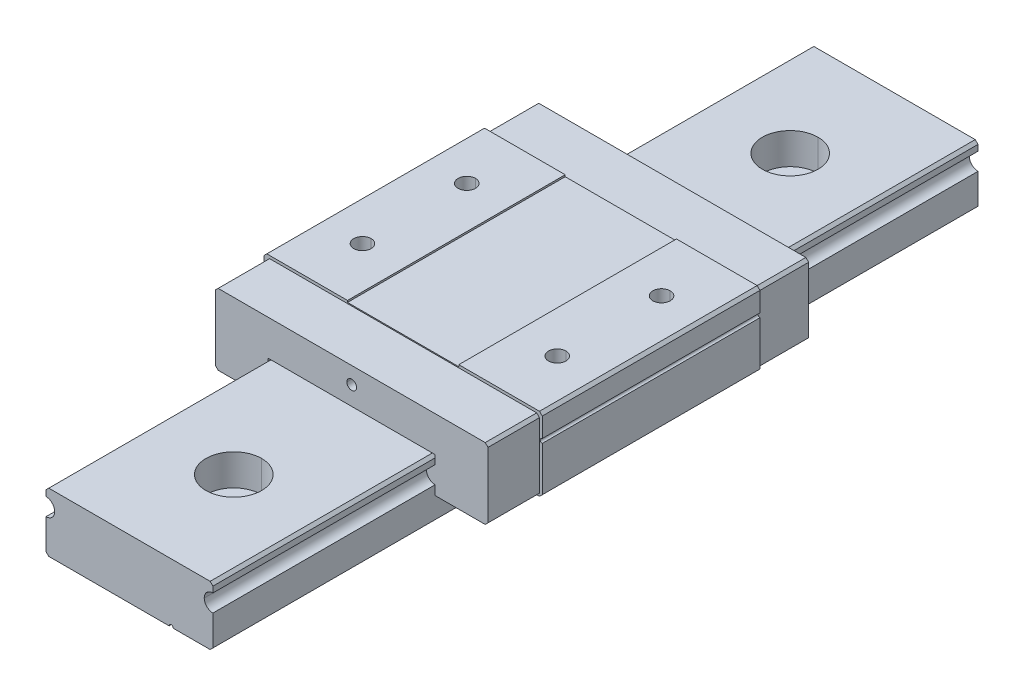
ISO-10303-21;
HEADER;
FILE_DESCRIPTION(('STEP AP214'),'2;1');
FILE_NAME('part.step','',(''),(''),'','','');
FILE_SCHEMA(('AUTOMOTIVE_DESIGN { 1 0 10303 214 1 1 1 1 }'));
ENDSEC;
DATA;
#1=APPLICATION_CONTEXT('core data for automotive mechanical design processes');
#2=APPLICATION_PROTOCOL_DEFINITION('international standard','automotive_design',2000,#1);
#3=PRODUCT_CONTEXT('',#1,'mechanical');
#4=PRODUCT('Part','Part','',(#3));
#5=PRODUCT_RELATED_PRODUCT_CATEGORY('part','',(#4));
#6=PRODUCT_DEFINITION_FORMATION('','',#4);
#7=PRODUCT_DEFINITION_CONTEXT('part definition',#1,'design');
#8=PRODUCT_DEFINITION('design','',#6,#7);
#9=PRODUCT_DEFINITION_SHAPE('','',#8);
#10=(LENGTH_UNIT() NAMED_UNIT(*) SI_UNIT(.MILLI.,.METRE.));
#11=(NAMED_UNIT(*) PLANE_ANGLE_UNIT() SI_UNIT($,.RADIAN.));
#12=(NAMED_UNIT(*) SI_UNIT($,.STERADIAN.) SOLID_ANGLE_UNIT());
#13=UNCERTAINTY_MEASURE_WITH_UNIT(LENGTH_MEASURE(1.E-05),#10,'distance_accuracy_value','');
#14=(GEOMETRIC_REPRESENTATION_CONTEXT(3) GLOBAL_UNCERTAINTY_ASSIGNED_CONTEXT((#13)) GLOBAL_UNIT_ASSIGNED_CONTEXT((#10,
#11,#12)) REPRESENTATION_CONTEXT('',''));
#15=CARTESIAN_POINT('',(0.,0.,0.));
#16=DIRECTION('',(0.,0.,1.));
#17=DIRECTION('',(1.,0.,0.));
#18=AXIS2_PLACEMENT_3D('',#15,#16,#17);
#19=CARTESIAN_POINT('',(0.,8.5,-40.));
#20=DIRECTION('',(0.,-1.,0.));
#21=DIRECTION('',(0.,0.,-1.));
#22=AXIS2_PLACEMENT_3D('',#19,#20,#21);
#23=CYLINDRICAL_SURFACE('',#22,4.);
#24=CARTESIAN_POINT('',(0.,8.5,-40.));
#25=DIRECTION('',(0.,1.,0.));
#26=DIRECTION('',(0.,0.,-1.));
#27=AXIS2_PLACEMENT_3D('',#24,#25,#26);
#28=CIRCLE('',#27,4.);
#29=CARTESIAN_POINT('',(0.,8.5,-44.));
#30=VERTEX_POINT('',#29);
#31=CARTESIAN_POINT('',(0.,8.5,-36.));
#32=VERTEX_POINT('',#31);
#33=EDGE_CURVE('P0_E10',#30,#32,#28,.T.);
#34=ORIENTED_EDGE('',*,*,#33,.T.);
#35=DIRECTION('',(0.,-1.,0.));
#36=VECTOR('',#35,1.);
#37=CARTESIAN_POINT('',(0.,8.5,-36.));
#38=LINE('',#37,#36);
#39=CARTESIAN_POINT('',(0.,4.,-36.));
#40=VERTEX_POINT('',#39);
#41=EDGE_CURVE('P0_E419',#32,#40,#38,.T.);
#42=ORIENTED_EDGE('',*,*,#41,.T.);
#43=CARTESIAN_POINT('',(0.,4.,-40.));
#44=DIRECTION('',(0.,1.,0.));
#45=DIRECTION('',(0.,0.,-1.));
#46=AXIS2_PLACEMENT_3D('',#43,#44,#45);
#47=CIRCLE('',#46,4.);
#48=CARTESIAN_POINT('',(0.,4.,-44.));
#49=VERTEX_POINT('',#48);
#50=EDGE_CURVE('P0_E387',#49,#40,#47,.T.);
#51=ORIENTED_EDGE('',*,*,#50,.F.);
#52=DIRECTION('',(0.,-1.,0.));
#53=VECTOR('',#52,1.);
#54=CARTESIAN_POINT('',(0.,8.5,-44.));
#55=LINE('',#54,#53);
#56=EDGE_CURVE('P0_E423',#30,#49,#55,.T.);
#57=ORIENTED_EDGE('',*,*,#56,.F.);
#58=EDGE_LOOP('',(#34,#42,#51,#57));
#59=FACE_BOUND('',#58,.T.);
#60=ADVANCED_FACE('P0_F16',(#59),#23,.F.);
#61=CARTESIAN_POINT('',(0.,8.5,0.));
#62=DIRECTION('',(0.,-1.,0.));
#63=DIRECTION('',(0.,0.,-1.));
#64=AXIS2_PLACEMENT_3D('',#61,#62,#63);
#65=CYLINDRICAL_SURFACE('',#64,4.);
#66=CARTESIAN_POINT('',(0.,8.5,0.));
#67=DIRECTION('',(0.,1.,0.));
#68=DIRECTION('',(0.,0.,-1.));
#69=AXIS2_PLACEMENT_3D('',#66,#67,#68);
#70=CIRCLE('',#69,4.);
#71=CARTESIAN_POINT('',(0.,8.5,-4.));
#72=VERTEX_POINT('',#71);
#73=CARTESIAN_POINT('',(0.,8.5,4.));
#74=VERTEX_POINT('',#73);
#75=EDGE_CURVE('P0_E25',#72,#74,#70,.T.);
#76=ORIENTED_EDGE('',*,*,#75,.T.);
#77=DIRECTION('',(0.,-1.,0.));
#78=VECTOR('',#77,1.);
#79=CARTESIAN_POINT('',(0.,8.5,4.));
#80=LINE('',#79,#78);
#81=CARTESIAN_POINT('',(0.,4.,4.));
#82=VERTEX_POINT('',#81);
#83=EDGE_CURVE('P0_E409',#74,#82,#80,.T.);
#84=ORIENTED_EDGE('',*,*,#83,.T.);
#85=CARTESIAN_POINT('',(0.,4.,0.));
#86=DIRECTION('',(0.,1.,0.));
#87=DIRECTION('',(0.,0.,-1.));
#88=AXIS2_PLACEMENT_3D('',#85,#86,#87);
#89=CIRCLE('',#88,4.);
#90=CARTESIAN_POINT('',(0.,4.,-4.));
#91=VERTEX_POINT('',#90);
#92=EDGE_CURVE('P0_E378',#91,#82,#89,.T.);
#93=ORIENTED_EDGE('',*,*,#92,.F.);
#94=DIRECTION('',(0.,-1.,0.));
#95=VECTOR('',#94,1.);
#96=CARTESIAN_POINT('',(0.,8.5,-4.));
#97=LINE('',#96,#95);
#98=EDGE_CURVE('P0_E416',#72,#91,#97,.T.);
#99=ORIENTED_EDGE('',*,*,#98,.F.);
#100=EDGE_LOOP('',(#76,#84,#93,#99));
#101=FACE_BOUND('',#100,.T.);
#102=ADVANCED_FACE('P0_F631',(#101),#65,.F.);
#103=CARTESIAN_POINT('',(0.,8.5,40.));
#104=DIRECTION('',(0.,-1.,0.));
#105=DIRECTION('',(0.,0.,-1.));
#106=AXIS2_PLACEMENT_3D('',#103,#104,#105);
#107=CYLINDRICAL_SURFACE('',#106,4.);
#108=CARTESIAN_POINT('',(0.,8.5,40.));
#109=DIRECTION('',(0.,1.,0.));
#110=DIRECTION('',(0.,0.,-1.));
#111=AXIS2_PLACEMENT_3D('',#108,#109,#110);
#112=CIRCLE('',#111,4.);
#113=CARTESIAN_POINT('',(0.,8.5,36.));
#114=VERTEX_POINT('',#113);
#115=CARTESIAN_POINT('',(0.,8.5,44.));
#116=VERTEX_POINT('',#115);
#117=EDGE_CURVE('P0_E337',#114,#116,#112,.T.);
#118=ORIENTED_EDGE('',*,*,#117,.T.);
#119=DIRECTION('',(0.,-1.,0.));
#120=VECTOR('',#119,1.);
#121=CARTESIAN_POINT('',(0.,8.5,44.));
#122=LINE('',#121,#120);
#123=CARTESIAN_POINT('',(0.,4.,44.));
#124=VERTEX_POINT('',#123);
#125=EDGE_CURVE('P0_E322',#116,#124,#122,.T.);
#126=ORIENTED_EDGE('',*,*,#125,.T.);
#127=CARTESIAN_POINT('',(0.,4.,40.));
#128=DIRECTION('',(0.,1.,0.));
#129=DIRECTION('',(0.,0.,-1.));
#130=AXIS2_PLACEMENT_3D('',#127,#128,#129);
#131=CIRCLE('',#130,4.);
#132=CARTESIAN_POINT('',(0.,4.,36.));
#133=VERTEX_POINT('',#132);
#134=EDGE_CURVE('P0_E370',#133,#124,#131,.T.);
#135=ORIENTED_EDGE('',*,*,#134,.F.);
#136=DIRECTION('',(0.,-1.,0.));
#137=VECTOR('',#136,1.);
#138=CARTESIAN_POINT('',(0.,8.5,36.));
#139=LINE('',#138,#137);
#140=EDGE_CURVE('P0_E406',#114,#133,#139,.T.);
#141=ORIENTED_EDGE('',*,*,#140,.F.);
#142=EDGE_LOOP('',(#118,#126,#135,#141));
#143=FACE_BOUND('',#142,.T.);
#144=ADVANCED_FACE('P0_F636',(#143),#107,.F.);
#145=CARTESIAN_POINT('',(12.,6.,55.));
#146=DIRECTION('',(0.,0.,-1.));
#147=DIRECTION('',(-1.,0.,0.));
#148=AXIS2_PLACEMENT_3D('',#145,#146,#147);
#149=CYLINDRICAL_SURFACE('',#148,1.25);
#150=CARTESIAN_POINT('',(12.,6.,55.));
#151=DIRECTION('',(0.,0.,1.));
#152=DIRECTION('',(-1.,0.,0.));
#153=AXIS2_PLACEMENT_3D('',#150,#151,#152);
#154=CIRCLE('',#153,1.25);
#155=CARTESIAN_POINT('',(12.,7.25,55.));
#156=VERTEX_POINT('',#155);
#157=CARTESIAN_POINT('',(10.75,6.,55.));
#158=VERTEX_POINT('',#157);
#159=EDGE_CURVE('P0_E346',#156,#158,#154,.T.);
#160=ORIENTED_EDGE('',*,*,#159,.T.);
#161=DIRECTION('',(0.,0.,-1.));
#162=VECTOR('',#161,1.);
#163=CARTESIAN_POINT('',(10.75,6.,55.));
#164=LINE('',#163,#162);
#165=CARTESIAN_POINT('',(10.75,6.,-55.));
#166=VERTEX_POINT('',#165);
#167=EDGE_CURVE('P0_E311',#158,#166,#164,.T.);
#168=ORIENTED_EDGE('',*,*,#167,.T.);
#169=CARTESIAN_POINT('',(12.,6.,-55.));
#170=DIRECTION('',(0.,0.,1.));
#171=DIRECTION('',(-1.,0.,0.));
#172=AXIS2_PLACEMENT_3D('',#169,#170,#171);
#173=CIRCLE('',#172,1.25);
#174=CARTESIAN_POINT('',(12.,7.25,-55.));
#175=VERTEX_POINT('',#174);
#176=EDGE_CURVE('P0_E392',#175,#166,#173,.T.);
#177=ORIENTED_EDGE('',*,*,#176,.F.);
#178=DIRECTION('',(0.,0.,-1.));
#179=VECTOR('',#178,1.);
#180=CARTESIAN_POINT('',(12.,7.25,55.));
#181=LINE('',#180,#179);
#182=EDGE_CURVE('P0_E307',#156,#175,#181,.T.);
#183=ORIENTED_EDGE('',*,*,#182,.F.);
#184=EDGE_LOOP('',(#160,#168,#177,#183));
#185=FACE_BOUND('',#184,.T.);
#186=ADVANCED_FACE('P0_F576',(#185),#149,.F.);
#187=CARTESIAN_POINT('',(0.,-18.4702192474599,-40.));
#188=DIRECTION('',(0.,-1.,0.));
#189=DIRECTION('',(0.,0.,-1.));
#190=AXIS2_PLACEMENT_3D('',#187,#188,#189);
#191=CYLINDRICAL_SURFACE('',#190,2.25);
#192=CARTESIAN_POINT('',(0.,4.,-40.));
#193=DIRECTION('',(0.,1.,0.));
#194=DIRECTION('',(0.,0.,-1.));
#195=AXIS2_PLACEMENT_3D('',#192,#193,#194);
#196=CIRCLE('',#195,2.25);
#197=CARTESIAN_POINT('',(0.,4.,-42.25));
#198=VERTEX_POINT('',#197);
#199=CARTESIAN_POINT('',(0.,4.,-37.75));
#200=VERTEX_POINT('',#199);
#201=EDGE_CURVE('P0_E331',#198,#200,#196,.T.);
#202=ORIENTED_EDGE('',*,*,#201,.T.);
#203=DIRECTION('',(0.,-1.,0.));
#204=VECTOR('',#203,1.);
#205=CARTESIAN_POINT('',(0.,-18.4702192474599,-37.75));
#206=LINE('',#205,#204);
#207=CARTESIAN_POINT('',(0.,0.,-37.75));
#208=VERTEX_POINT('',#207);
#209=EDGE_CURVE('P0_E503',#200,#208,#206,.T.);
#210=ORIENTED_EDGE('',*,*,#209,.T.);
#211=CARTESIAN_POINT('',(0.,0.,-40.));
#212=DIRECTION('',(0.,-1.,0.));
#213=DIRECTION('',(0.,0.,-1.));
#214=AXIS2_PLACEMENT_3D('',#211,#212,#213);
#215=CIRCLE('',#214,2.25);
#216=CARTESIAN_POINT('',(0.,0.,-42.25));
#217=VERTEX_POINT('',#216);
#218=EDGE_CURVE('P0_E354',#208,#217,#215,.T.);
#219=ORIENTED_EDGE('',*,*,#218,.T.);
#220=DIRECTION('',(0.,-1.,0.));
#221=VECTOR('',#220,1.);
#222=CARTESIAN_POINT('',(0.,-18.4702192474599,-42.25));
#223=LINE('',#222,#221);
#224=EDGE_CURVE('P0_E553',#198,#217,#223,.T.);
#225=ORIENTED_EDGE('',*,*,#224,.F.);
#226=EDGE_LOOP('',(#202,#210,#219,#225));
#227=FACE_BOUND('',#226,.T.);
#228=ADVANCED_FACE('P0_F718',(#227),#191,.F.);
#229=CARTESIAN_POINT('',(0.,-18.4702192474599,0.));
#230=DIRECTION('',(0.,-1.,0.));
#231=DIRECTION('',(0.,0.,-1.));
#232=AXIS2_PLACEMENT_3D('',#229,#230,#231);
#233=CYLINDRICAL_SURFACE('',#232,2.25);
#234=CARTESIAN_POINT('',(0.,4.,0.));
#235=DIRECTION('',(0.,1.,0.));
#236=DIRECTION('',(0.,0.,-1.));
#237=AXIS2_PLACEMENT_3D('',#234,#235,#236);
#238=CIRCLE('',#237,2.25);
#239=CARTESIAN_POINT('',(0.,4.,-2.25));
#240=VERTEX_POINT('',#239);
#241=CARTESIAN_POINT('',(0.,4.,2.25));
#242=VERTEX_POINT('',#241);
#243=EDGE_CURVE('P0_E386',#240,#242,#238,.T.);
#244=ORIENTED_EDGE('',*,*,#243,.T.);
#245=DIRECTION('',(0.,-1.,0.));
#246=VECTOR('',#245,1.);
#247=CARTESIAN_POINT('',(0.,-18.4702192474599,2.25));
#248=LINE('',#247,#246);
#249=CARTESIAN_POINT('',(0.,0.,2.25));
#250=VERTEX_POINT('',#249);
#251=EDGE_CURVE('P0_E477',#242,#250,#248,.T.);
#252=ORIENTED_EDGE('',*,*,#251,.T.);
#253=CARTESIAN_POINT('',(0.,0.,0.));
#254=DIRECTION('',(0.,-1.,0.));
#255=DIRECTION('',(0.,0.,-1.));
#256=AXIS2_PLACEMENT_3D('',#253,#254,#255);
#257=CIRCLE('',#256,2.25);
#258=CARTESIAN_POINT('',(0.,0.,-2.25));
#259=VERTEX_POINT('',#258);
#260=EDGE_CURVE('P0_E302',#250,#259,#257,.T.);
#261=ORIENTED_EDGE('',*,*,#260,.T.);
#262=DIRECTION('',(0.,-1.,0.));
#263=VECTOR('',#262,1.);
#264=CARTESIAN_POINT('',(0.,-18.4702192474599,-2.25));
#265=LINE('',#264,#263);
#266=EDGE_CURVE('P0_E541',#240,#259,#265,.T.);
#267=ORIENTED_EDGE('',*,*,#266,.F.);
#268=EDGE_LOOP('',(#244,#252,#261,#267));
#269=FACE_BOUND('',#268,.T.);
#270=ADVANCED_FACE('P0_F627',(#269),#233,.F.);
#271=CARTESIAN_POINT('',(0.,-18.4702192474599,40.));
#272=DIRECTION('',(0.,-1.,0.));
#273=DIRECTION('',(0.,0.,-1.));
#274=AXIS2_PLACEMENT_3D('',#271,#272,#273);
#275=CYLINDRICAL_SURFACE('',#274,2.25);
#276=CARTESIAN_POINT('',(0.,4.,40.));
#277=DIRECTION('',(0.,1.,0.));
#278=DIRECTION('',(0.,0.,-1.));
#279=AXIS2_PLACEMENT_3D('',#276,#277,#278);
#280=CIRCLE('',#279,2.25);
#281=CARTESIAN_POINT('',(0.,4.,37.75));
#282=VERTEX_POINT('',#281);
#283=CARTESIAN_POINT('',(0.,4.,42.25));
#284=VERTEX_POINT('',#283);
#285=EDGE_CURVE('P0_E291',#282,#284,#280,.T.);
#286=ORIENTED_EDGE('',*,*,#285,.T.);
#287=DIRECTION('',(0.,-1.,0.));
#288=VECTOR('',#287,1.);
#289=CARTESIAN_POINT('',(0.,-18.4702192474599,42.25));
#290=LINE('',#289,#288);
#291=CARTESIAN_POINT('',(0.,0.,42.25));
#292=VERTEX_POINT('',#291);
#293=EDGE_CURVE('P0_E446',#284,#292,#290,.T.);
#294=ORIENTED_EDGE('',*,*,#293,.T.);
#295=CARTESIAN_POINT('',(0.,0.,40.));
#296=DIRECTION('',(0.,-1.,0.));
#297=DIRECTION('',(0.,0.,-1.));
#298=AXIS2_PLACEMENT_3D('',#295,#296,#297);
#299=CIRCLE('',#298,2.25);
#300=CARTESIAN_POINT('',(0.,0.,37.75));
#301=VERTEX_POINT('',#300);
#302=EDGE_CURVE('P0_E299',#292,#301,#299,.T.);
#303=ORIENTED_EDGE('',*,*,#302,.T.);
#304=DIRECTION('',(0.,-1.,0.));
#305=VECTOR('',#304,1.);
#306=CARTESIAN_POINT('',(0.,-18.4702192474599,37.75));
#307=LINE('',#306,#305);
#308=EDGE_CURVE('P0_E445',#282,#301,#307,.T.);
#309=ORIENTED_EDGE('',*,*,#308,.F.);
#310=EDGE_LOOP('',(#286,#294,#303,#309));
#311=FACE_BOUND('',#310,.T.);
#312=ADVANCED_FACE('P0_F618',(#311),#275,.F.);
#313=CARTESIAN_POINT('',(12.,8.5,55.));
#314=DIRECTION('',(0.,-1.,0.));
#315=DIRECTION('',(0.,0.,-1.));
#316=AXIS2_PLACEMENT_3D('',#313,#314,#315);
#317=PLANE('',#316);
#318=ORIENTED_EDGE('',*,*,#33,.F.);
#319=CARTESIAN_POINT('',(0.,8.5,-40.));
#320=DIRECTION('',(0.,1.,0.));
#321=DIRECTION('',(0.,0.,-1.));
#322=AXIS2_PLACEMENT_3D('',#319,#320,#321);
#323=CIRCLE('',#322,4.);
#324=EDGE_CURVE('P0_E420',#32,#30,#323,.T.);
#325=ORIENTED_EDGE('',*,*,#324,.F.);
#326=EDGE_LOOP('',(#318,#325));
#327=FACE_BOUND('',#326,.T.);
#328=ORIENTED_EDGE('',*,*,#75,.F.);
#329=CARTESIAN_POINT('',(0.,8.5,0.));
#330=DIRECTION('',(0.,1.,0.));
#331=DIRECTION('',(0.,0.,-1.));
#332=AXIS2_PLACEMENT_3D('',#329,#330,#331);
#333=CIRCLE('',#332,4.);
#334=EDGE_CURVE('P0_E412',#74,#72,#333,.T.);
#335=ORIENTED_EDGE('',*,*,#334,.F.);
#336=EDGE_LOOP('',(#328,#335));
#337=FACE_BOUND('',#336,.T.);
#338=ORIENTED_EDGE('',*,*,#117,.F.);
#339=CARTESIAN_POINT('',(0.,8.5,40.));
#340=DIRECTION('',(0.,1.,0.));
#341=DIRECTION('',(0.,0.,-1.));
#342=AXIS2_PLACEMENT_3D('',#339,#340,#341);
#343=CIRCLE('',#342,4.);
#344=EDGE_CURVE('P0_E402',#116,#114,#343,.T.);
#345=ORIENTED_EDGE('',*,*,#344,.F.);
#346=EDGE_LOOP('',(#338,#345));
#347=FACE_BOUND('',#346,.T.);
#348=DIRECTION('',(-1.,0.,0.));
#349=VECTOR('',#348,1.);
#350=CARTESIAN_POINT('',(12.,8.5,55.));
#351=LINE('',#350,#349);
#352=CARTESIAN_POINT('',(11.6,8.5,55.));
#353=VERTEX_POINT('',#352);
#354=CARTESIAN_POINT('',(-11.6,8.5,55.));
#355=VERTEX_POINT('',#354);
#356=EDGE_CURVE('P0_E263',#353,#355,#351,.T.);
#357=ORIENTED_EDGE('',*,*,#356,.F.);
#358=DIRECTION('',(0.,0.,1.));
#359=VECTOR('',#358,1.);
#360=CARTESIAN_POINT('',(11.6,8.5,55.));
#361=LINE('',#360,#359);
#362=CARTESIAN_POINT('',(11.6,8.5,-55.));
#363=VERTEX_POINT('',#362);
#364=EDGE_CURVE('P0_E349',#363,#353,#361,.T.);
#365=ORIENTED_EDGE('',*,*,#364,.F.);
#366=DIRECTION('',(1.,0.,0.));
#367=VECTOR('',#366,1.);
#368=CARTESIAN_POINT('',(12.,8.5,-55.));
#369=LINE('',#368,#367);
#370=CARTESIAN_POINT('',(-11.6,8.5,-55.));
#371=VERTEX_POINT('',#370);
#372=EDGE_CURVE('P0_E330',#371,#363,#369,.T.);
#373=ORIENTED_EDGE('',*,*,#372,.F.);
#374=DIRECTION('',(0.,0.,-1.));
#375=VECTOR('',#374,1.);
#376=CARTESIAN_POINT('',(-11.6,8.5,55.));
#377=LINE('',#376,#375);
#378=EDGE_CURVE('P0_E266',#355,#371,#377,.T.);
#379=ORIENTED_EDGE('',*,*,#378,.F.);
#380=EDGE_LOOP('',(#357,#365,#373,#379));
#381=FACE_BOUND('',#380,.T.);
#382=ADVANCED_FACE('P0_F615',(#327,#337,#347,#381),#317,.F.);
#383=CARTESIAN_POINT('',(0.,8.5,-40.));
#384=DIRECTION('',(0.,-1.,0.));
#385=DIRECTION('',(0.,0.,-1.));
#386=AXIS2_PLACEMENT_3D('',#383,#384,#385);
#387=CYLINDRICAL_SURFACE('',#386,4.);
#388=ORIENTED_EDGE('',*,*,#41,.F.);
#389=ORIENTED_EDGE('',*,*,#324,.T.);
#390=ORIENTED_EDGE('',*,*,#56,.T.);
#391=CARTESIAN_POINT('',(0.,4.,-40.));
#392=DIRECTION('',(0.,1.,0.));
#393=DIRECTION('',(0.,0.,-1.));
#394=AXIS2_PLACEMENT_3D('',#391,#392,#393);
#395=CIRCLE('',#394,4.);
#396=EDGE_CURVE('P0_E391',#40,#49,#395,.T.);
#397=ORIENTED_EDGE('',*,*,#396,.F.);
#398=EDGE_LOOP('',(#388,#389,#390,#397));
#399=FACE_BOUND('',#398,.T.);
#400=ADVANCED_FACE('P0_F617',(#399),#387,.F.);
#401=CARTESIAN_POINT('',(0.,8.5,0.));
#402=DIRECTION('',(0.,-1.,0.));
#403=DIRECTION('',(0.,0.,-1.));
#404=AXIS2_PLACEMENT_3D('',#401,#402,#403);
#405=CYLINDRICAL_SURFACE('',#404,4.);
#406=ORIENTED_EDGE('',*,*,#83,.F.);
#407=ORIENTED_EDGE('',*,*,#334,.T.);
#408=ORIENTED_EDGE('',*,*,#98,.T.);
#409=CARTESIAN_POINT('',(0.,4.,0.));
#410=DIRECTION('',(0.,1.,0.));
#411=DIRECTION('',(0.,0.,-1.));
#412=AXIS2_PLACEMENT_3D('',#409,#410,#411);
#413=CIRCLE('',#412,4.);
#414=EDGE_CURVE('P0_E382',#82,#91,#413,.T.);
#415=ORIENTED_EDGE('',*,*,#414,.F.);
#416=EDGE_LOOP('',(#406,#407,#408,#415));
#417=FACE_BOUND('',#416,.T.);
#418=ADVANCED_FACE('P0_F625',(#417),#405,.F.);
#419=CARTESIAN_POINT('',(0.,8.5,40.));
#420=DIRECTION('',(0.,-1.,0.));
#421=DIRECTION('',(0.,0.,-1.));
#422=AXIS2_PLACEMENT_3D('',#419,#420,#421);
#423=CYLINDRICAL_SURFACE('',#422,4.);
#424=ORIENTED_EDGE('',*,*,#125,.F.);
#425=ORIENTED_EDGE('',*,*,#344,.T.);
#426=ORIENTED_EDGE('',*,*,#140,.T.);
#427=CARTESIAN_POINT('',(0.,4.,40.));
#428=DIRECTION('',(0.,1.,0.));
#429=DIRECTION('',(0.,0.,-1.));
#430=AXIS2_PLACEMENT_3D('',#427,#428,#429);
#431=CIRCLE('',#430,4.);
#432=EDGE_CURVE('P0_E374',#124,#133,#431,.T.);
#433=ORIENTED_EDGE('',*,*,#432,.F.);
#434=EDGE_LOOP('',(#424,#425,#426,#433));
#435=FACE_BOUND('',#434,.T.);
#436=ADVANCED_FACE('P0_F696',(#435),#423,.F.);
#437=CARTESIAN_POINT('',(-12.,8.1,55.));
#438=DIRECTION('',(0.707106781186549,-0.707106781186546,0.));
#439=DIRECTION('',(0.,0.,-1.));
#440=AXIS2_PLACEMENT_3D('',#437,#438,#439);
#441=PLANE('',#440);
#442=DIRECTION('',(-0.707106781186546,-0.707106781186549,0.));
#443=VECTOR('',#442,1.);
#444=CARTESIAN_POINT('',(-12.,8.1,55.));
#445=LINE('',#444,#443);
#446=CARTESIAN_POINT('',(-12.,8.1,55.));
#447=VERTEX_POINT('',#446);
#448=EDGE_CURVE('P0_E256',#355,#447,#445,.T.);
#449=ORIENTED_EDGE('',*,*,#448,.F.);
#450=ORIENTED_EDGE('',*,*,#378,.T.);
#451=DIRECTION('',(0.707106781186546,0.707106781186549,0.));
#452=VECTOR('',#451,1.);
#453=CARTESIAN_POINT('',(-12.,8.1,-55.));
#454=LINE('',#453,#452);
#455=CARTESIAN_POINT('',(-12.,8.1,-55.));
#456=VERTEX_POINT('',#455);
#457=EDGE_CURVE('P0_E272',#456,#371,#454,.T.);
#458=ORIENTED_EDGE('',*,*,#457,.F.);
#459=DIRECTION('',(0.,0.,-1.));
#460=VECTOR('',#459,1.);
#461=CARTESIAN_POINT('',(-12.,8.1,55.));
#462=LINE('',#461,#460);
#463=EDGE_CURVE('P0_E269',#447,#456,#462,.T.);
#464=ORIENTED_EDGE('',*,*,#463,.F.);
#465=EDGE_LOOP('',(#449,#450,#458,#464));
#466=FACE_BOUND('',#465,.T.);
#467=ADVANCED_FACE('P0_F270',(#466),#441,.F.);
#468=CARTESIAN_POINT('',(6.,0.,55.));
#469=DIRECTION('',(0.,0.,-1.));
#470=DIRECTION('',(0.,-1.,0.));
#471=AXIS2_PLACEMENT_3D('',#468,#469,#470);
#472=PLANE('',#471);
#473=DIRECTION('',(0.,1.,0.));
#474=VECTOR('',#473,1.);
#475=CARTESIAN_POINT('',(-12.,0.,55.));
#476=LINE('',#475,#474);
#477=CARTESIAN_POINT('',(-12.,7.25,55.));
#478=VERTEX_POINT('',#477);
#479=EDGE_CURVE('P0_E260',#478,#447,#476,.T.);
#480=ORIENTED_EDGE('',*,*,#479,.F.);
#481=CARTESIAN_POINT('',(-12.,6.,55.));
#482=DIRECTION('',(0.,0.,1.));
#483=DIRECTION('',(-1.,0.,0.));
#484=AXIS2_PLACEMENT_3D('',#481,#482,#483);
#485=CIRCLE('',#484,1.25);
#486=CARTESIAN_POINT('',(-12.,4.75,55.));
#487=VERTEX_POINT('',#486);
#488=EDGE_CURVE('P0_E287',#487,#478,#485,.T.);
#489=ORIENTED_EDGE('',*,*,#488,.F.);
#490=DIRECTION('',(0.,1.,0.));
#491=VECTOR('',#490,1.);
#492=CARTESIAN_POINT('',(-12.,0.,55.));
#493=LINE('',#492,#491);
#494=CARTESIAN_POINT('',(-12.,0.4,55.));
#495=VERTEX_POINT('',#494);
#496=EDGE_CURVE('P0_E359',#495,#487,#493,.T.);
#497=ORIENTED_EDGE('',*,*,#496,.F.);
#498=DIRECTION('',(0.707106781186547,-0.707106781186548,0.));
#499=VECTOR('',#498,1.);
#500=CARTESIAN_POINT('',(-11.6,0.,55.));
#501=LINE('',#500,#499);
#502=CARTESIAN_POINT('',(-11.6,0.,55.));
#503=VERTEX_POINT('',#502);
#504=EDGE_CURVE('P0_E459',#495,#503,#501,.T.);
#505=ORIENTED_EDGE('',*,*,#504,.T.);
#506=DIRECTION('',(-1.,0.,0.));
#507=VECTOR('',#506,1.);
#508=CARTESIAN_POINT('',(6.,0.,55.));
#509=LINE('',#508,#507);
#510=CARTESIAN_POINT('',(5.7,0.,55.));
#511=VERTEX_POINT('',#510);
#512=EDGE_CURVE('P0_E343',#511,#503,#509,.T.);
#513=ORIENTED_EDGE('',*,*,#512,.F.);
#514=CARTESIAN_POINT('',(6.,0.,55.));
#515=DIRECTION('',(0.,0.,-1.));
#516=DIRECTION('',(-1.,0.,0.));
#517=AXIS2_PLACEMENT_3D('',#514,#515,#516);
#518=CIRCLE('',#517,0.3);
#519=CARTESIAN_POINT('',(6.3,0.,55.));
#520=VERTEX_POINT('',#519);
#521=EDGE_CURVE('P0_E472',#511,#520,#518,.T.);
#522=ORIENTED_EDGE('',*,*,#521,.T.);
#523=DIRECTION('',(-1.,0.,0.));
#524=VECTOR('',#523,1.);
#525=CARTESIAN_POINT('',(6.,0.,55.));
#526=LINE('',#525,#524);
#527=CARTESIAN_POINT('',(11.6,0.,55.));
#528=VERTEX_POINT('',#527);
#529=EDGE_CURVE('P0_E340',#528,#520,#526,.T.);
#530=ORIENTED_EDGE('',*,*,#529,.F.);
#531=DIRECTION('',(0.707106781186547,0.707106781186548,0.));
#532=VECTOR('',#531,1.);
#533=CARTESIAN_POINT('',(12.,0.4,55.));
#534=LINE('',#533,#532);
#535=CARTESIAN_POINT('',(12.,0.4,55.));
#536=VERTEX_POINT('',#535);
#537=EDGE_CURVE('P0_E447',#528,#536,#534,.T.);
#538=ORIENTED_EDGE('',*,*,#537,.T.);
#539=DIRECTION('',(0.,-1.,0.));
#540=VECTOR('',#539,1.);
#541=CARTESIAN_POINT('',(12.,0.,55.));
#542=LINE('',#541,#540);
#543=CARTESIAN_POINT('',(12.,4.75,55.));
#544=VERTEX_POINT('',#543);
#545=EDGE_CURVE('P0_E323',#544,#536,#542,.T.);
#546=ORIENTED_EDGE('',*,*,#545,.F.);
#547=CARTESIAN_POINT('',(12.,6.,55.));
#548=DIRECTION('',(0.,0.,1.));
#549=DIRECTION('',(-1.,0.,0.));
#550=AXIS2_PLACEMENT_3D('',#547,#548,#549);
#551=CIRCLE('',#550,1.25);
#552=EDGE_CURVE('P0_E314',#158,#544,#551,.T.);
#553=ORIENTED_EDGE('',*,*,#552,.F.);
#554=ORIENTED_EDGE('',*,*,#159,.F.);
#555=DIRECTION('',(0.,1.,0.));
#556=VECTOR('',#555,1.);
#557=CARTESIAN_POINT('',(12.,7.25,55.));
#558=LINE('',#557,#556);
#559=CARTESIAN_POINT('',(12.,8.1,55.));
#560=VERTEX_POINT('',#559);
#561=EDGE_CURVE('P0_E297',#156,#560,#558,.T.);
#562=ORIENTED_EDGE('',*,*,#561,.T.);
#563=DIRECTION('',(0.707106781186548,-0.707106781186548,0.));
#564=VECTOR('',#563,1.);
#565=CARTESIAN_POINT('',(11.6,8.5,55.));
#566=LINE('',#565,#564);
#567=EDGE_CURVE('P0_E395',#353,#560,#566,.T.);
#568=ORIENTED_EDGE('',*,*,#567,.F.);
#569=ORIENTED_EDGE('',*,*,#356,.T.);
#570=ORIENTED_EDGE('',*,*,#448,.T.);
#571=EDGE_LOOP('',(#480,#489,#497,#505,#513,#522,#530,#538,#546,#553,#554,#562,#568,#569,#570));
#572=FACE_BOUND('',#571,.T.);
#573=ADVANCED_FACE('P0_F258',(#572),#472,.F.);
#574=CARTESIAN_POINT('',(11.6,8.5,55.));
#575=DIRECTION('',(-0.707106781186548,-0.707106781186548,0.));
#576=DIRECTION('',(-0.707106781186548,0.707106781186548,0.));
#577=AXIS2_PLACEMENT_3D('',#574,#575,#576);
#578=PLANE('',#577);
#579=ORIENTED_EDGE('',*,*,#567,.T.);
#580=DIRECTION('',(0.,0.,1.));
#581=VECTOR('',#580,1.);
#582=CARTESIAN_POINT('',(12.,8.1,55.));
#583=LINE('',#582,#581);
#584=CARTESIAN_POINT('',(12.,8.1,-55.));
#585=VERTEX_POINT('',#584);
#586=EDGE_CURVE('P0_E293',#585,#560,#583,.T.);
#587=ORIENTED_EDGE('',*,*,#586,.F.);
#588=DIRECTION('',(0.707106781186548,-0.707106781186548,0.));
#589=VECTOR('',#588,1.);
#590=CARTESIAN_POINT('',(11.6,8.5,-55.));
#591=LINE('',#590,#589);
#592=EDGE_CURVE('P0_E396',#363,#585,#591,.T.);
#593=ORIENTED_EDGE('',*,*,#592,.F.);
#594=ORIENTED_EDGE('',*,*,#364,.T.);
#595=EDGE_LOOP('',(#579,#587,#593,#594));
#596=FACE_BOUND('',#595,.T.);
#597=ADVANCED_FACE('P0_F612',(#596),#578,.F.);
#598=CARTESIAN_POINT('',(6.,0.,-55.));
#599=DIRECTION('',(0.,0.,-1.));
#600=DIRECTION('',(0.,-1.,0.));
#601=AXIS2_PLACEMENT_3D('',#598,#599,#600);
#602=PLANE('',#601);
#603=DIRECTION('',(-1.,0.,0.));
#604=VECTOR('',#603,1.);
#605=CARTESIAN_POINT('',(6.,0.,-55.));
#606=LINE('',#605,#604);
#607=CARTESIAN_POINT('',(11.6,0.,-55.));
#608=VERTEX_POINT('',#607);
#609=CARTESIAN_POINT('',(6.3,0.,-55.));
#610=VERTEX_POINT('',#609);
#611=EDGE_CURVE('P0_E334',#608,#610,#606,.T.);
#612=ORIENTED_EDGE('',*,*,#611,.T.);
#613=CARTESIAN_POINT('',(6.,0.,-55.));
#614=DIRECTION('',(0.,0.,1.));
#615=DIRECTION('',(-1.,0.,0.));
#616=AXIS2_PLACEMENT_3D('',#613,#614,#615);
#617=CIRCLE('',#616,0.3);
#618=CARTESIAN_POINT('',(5.7,0.,-55.));
#619=VERTEX_POINT('',#618);
#620=EDGE_CURVE('P0_E489',#610,#619,#617,.T.);
#621=ORIENTED_EDGE('',*,*,#620,.T.);
#622=DIRECTION('',(-1.,0.,0.));
#623=VECTOR('',#622,1.);
#624=CARTESIAN_POINT('',(6.,0.,-55.));
#625=LINE('',#624,#623);
#626=CARTESIAN_POINT('',(-11.6,0.,-55.));
#627=VERTEX_POINT('',#626);
#628=EDGE_CURVE('P0_E303',#619,#627,#625,.T.);
#629=ORIENTED_EDGE('',*,*,#628,.T.);
#630=DIRECTION('',(-0.707106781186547,0.707106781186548,0.));
#631=VECTOR('',#630,1.);
#632=CARTESIAN_POINT('',(-11.6,0.,-55.));
#633=LINE('',#632,#631);
#634=CARTESIAN_POINT('',(-12.,0.4,-55.));
#635=VERTEX_POINT('',#634);
#636=EDGE_CURVE('P0_E458',#627,#635,#633,.T.);
#637=ORIENTED_EDGE('',*,*,#636,.T.);
#638=DIRECTION('',(0.,1.,0.));
#639=VECTOR('',#638,1.);
#640=CARTESIAN_POINT('',(-12.,0.,-55.));
#641=LINE('',#640,#639);
#642=CARTESIAN_POINT('',(-12.,4.75,-55.));
#643=VERTEX_POINT('',#642);
#644=EDGE_CURVE('P0_E355',#635,#643,#641,.T.);
#645=ORIENTED_EDGE('',*,*,#644,.T.);
#646=CARTESIAN_POINT('',(-12.,6.,-55.));
#647=DIRECTION('',(0.,0.,1.));
#648=DIRECTION('',(-1.,0.,0.));
#649=AXIS2_PLACEMENT_3D('',#646,#647,#648);
#650=CIRCLE('',#649,1.25);
#651=CARTESIAN_POINT('',(-12.,7.25,-55.));
#652=VERTEX_POINT('',#651);
#653=EDGE_CURVE('P0_E364',#643,#652,#650,.T.);
#654=ORIENTED_EDGE('',*,*,#653,.T.);
#655=DIRECTION('',(0.,1.,0.));
#656=VECTOR('',#655,1.);
#657=CARTESIAN_POINT('',(-12.,0.,-55.));
#658=LINE('',#657,#656);
#659=EDGE_CURVE('P0_E276',#652,#456,#658,.T.);
#660=ORIENTED_EDGE('',*,*,#659,.T.);
#661=ORIENTED_EDGE('',*,*,#457,.T.);
#662=ORIENTED_EDGE('',*,*,#372,.T.);
#663=ORIENTED_EDGE('',*,*,#592,.T.);
#664=DIRECTION('',(0.,-1.,0.));
#665=VECTOR('',#664,1.);
#666=CARTESIAN_POINT('',(12.,0.,-55.));
#667=LINE('',#666,#665);
#668=EDGE_CURVE('P0_E298',#585,#175,#667,.T.);
#669=ORIENTED_EDGE('',*,*,#668,.T.);
#670=ORIENTED_EDGE('',*,*,#176,.T.);
#671=CARTESIAN_POINT('',(12.,6.,-55.));
#672=DIRECTION('',(0.,0.,1.));
#673=DIRECTION('',(-1.,0.,0.));
#674=AXIS2_PLACEMENT_3D('',#671,#672,#673);
#675=CIRCLE('',#674,1.25);
#676=CARTESIAN_POINT('',(12.,4.75,-55.));
#677=VERTEX_POINT('',#676);
#678=EDGE_CURVE('P0_E327',#166,#677,#675,.T.);
#679=ORIENTED_EDGE('',*,*,#678,.T.);
#680=DIRECTION('',(0.,-1.,0.));
#681=VECTOR('',#680,1.);
#682=CARTESIAN_POINT('',(12.,0.,-55.));
#683=LINE('',#682,#681);
#684=CARTESIAN_POINT('',(12.,0.4,-55.));
#685=VERTEX_POINT('',#684);
#686=EDGE_CURVE('P0_E326',#677,#685,#683,.T.);
#687=ORIENTED_EDGE('',*,*,#686,.T.);
#688=DIRECTION('',(-0.707106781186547,-0.707106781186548,0.));
#689=VECTOR('',#688,1.);
#690=CARTESIAN_POINT('',(12.,0.4,-55.));
#691=LINE('',#690,#689);
#692=EDGE_CURVE('P0_E463',#685,#608,#691,.T.);
#693=ORIENTED_EDGE('',*,*,#692,.T.);
#694=EDGE_LOOP('',(#612,#621,#629,#637,#645,#654,#660,#661,#662,#663,#669,#670,#679,#687,#693));
#695=FACE_BOUND('',#694,.T.);
#696=ADVANCED_FACE('P0_F567',(#695),#602,.T.);
#697=CARTESIAN_POINT('',(0.,4.,-40.));
#698=DIRECTION('',(0.,-1.,0.));
#699=DIRECTION('',(0.,0.,-1.));
#700=AXIS2_PLACEMENT_3D('',#697,#698,#699);
#701=PLANE('',#700);
#702=ORIENTED_EDGE('',*,*,#201,.F.);
#703=CARTESIAN_POINT('',(0.,4.,-40.));
#704=DIRECTION('',(0.,1.,0.));
#705=DIRECTION('',(0.,0.,-1.));
#706=AXIS2_PLACEMENT_3D('',#703,#704,#705);
#707=CIRCLE('',#706,2.25);
#708=EDGE_CURVE('P0_E507',#200,#198,#707,.T.);
#709=ORIENTED_EDGE('',*,*,#708,.F.);
#710=EDGE_LOOP('',(#702,#709));
#711=FACE_BOUND('',#710,.T.);
#712=ORIENTED_EDGE('',*,*,#50,.T.);
#713=ORIENTED_EDGE('',*,*,#396,.T.);
#714=EDGE_LOOP('',(#712,#713));
#715=FACE_BOUND('',#714,.T.);
#716=ADVANCED_FACE('P0_F640',(#711,#715),#701,.F.);
#717=CARTESIAN_POINT('',(0.,4.,0.));
#718=DIRECTION('',(0.,-1.,0.));
#719=DIRECTION('',(0.,0.,-1.));
#720=AXIS2_PLACEMENT_3D('',#717,#718,#719);
#721=PLANE('',#720);
#722=ORIENTED_EDGE('',*,*,#243,.F.);
#723=CARTESIAN_POINT('',(0.,4.,0.));
#724=DIRECTION('',(0.,1.,0.));
#725=DIRECTION('',(0.,0.,-1.));
#726=AXIS2_PLACEMENT_3D('',#723,#724,#725);
#727=CIRCLE('',#726,2.25);
#728=EDGE_CURVE('P0_E532',#242,#240,#727,.T.);
#729=ORIENTED_EDGE('',*,*,#728,.F.);
#730=EDGE_LOOP('',(#722,#729));
#731=FACE_BOUND('',#730,.T.);
#732=ORIENTED_EDGE('',*,*,#92,.T.);
#733=ORIENTED_EDGE('',*,*,#414,.T.);
#734=EDGE_LOOP('',(#732,#733));
#735=FACE_BOUND('',#734,.T.);
#736=ADVANCED_FACE('P0_F642',(#731,#735),#721,.F.);
#737=CARTESIAN_POINT('',(0.,4.,40.));
#738=DIRECTION('',(0.,-1.,0.));
#739=DIRECTION('',(0.,0.,-1.));
#740=AXIS2_PLACEMENT_3D('',#737,#738,#739);
#741=PLANE('',#740);
#742=ORIENTED_EDGE('',*,*,#285,.F.);
#743=CARTESIAN_POINT('',(0.,4.,40.));
#744=DIRECTION('',(0.,1.,0.));
#745=DIRECTION('',(0.,0.,-1.));
#746=AXIS2_PLACEMENT_3D('',#743,#744,#745);
#747=CIRCLE('',#746,2.25);
#748=EDGE_CURVE('P0_E441',#284,#282,#747,.T.);
#749=ORIENTED_EDGE('',*,*,#748,.F.);
#750=EDGE_LOOP('',(#742,#749));
#751=FACE_BOUND('',#750,.T.);
#752=ORIENTED_EDGE('',*,*,#134,.T.);
#753=ORIENTED_EDGE('',*,*,#432,.T.);
#754=EDGE_LOOP('',(#752,#753));
#755=FACE_BOUND('',#754,.T.);
#756=ADVANCED_FACE('P0_F649',(#751,#755),#741,.F.);
#757=CARTESIAN_POINT('',(-12.,8.5,55.));
#758=DIRECTION('',(1.,0.,0.));
#759=DIRECTION('',(0.,1.,0.));
#760=AXIS2_PLACEMENT_3D('',#757,#758,#759);
#761=PLANE('',#760);
#762=ORIENTED_EDGE('',*,*,#479,.T.);
#763=ORIENTED_EDGE('',*,*,#463,.T.);
#764=ORIENTED_EDGE('',*,*,#659,.F.);
#765=DIRECTION('',(0.,0.,-1.));
#766=VECTOR('',#765,1.);
#767=CARTESIAN_POINT('',(-12.,7.25,55.));
#768=LINE('',#767,#766);
#769=EDGE_CURVE('P0_E280',#478,#652,#768,.T.);
#770=ORIENTED_EDGE('',*,*,#769,.F.);
#771=EDGE_LOOP('',(#762,#763,#764,#770));
#772=FACE_BOUND('',#771,.T.);
#773=ADVANCED_FACE('P0_F278',(#772),#761,.F.);
#774=CARTESIAN_POINT('',(-12.,6.,55.));
#775=DIRECTION('',(0.,0.,-1.));
#776=DIRECTION('',(-1.,0.,0.));
#777=AXIS2_PLACEMENT_3D('',#774,#775,#776);
#778=CYLINDRICAL_SURFACE('',#777,1.25);
#779=ORIENTED_EDGE('',*,*,#653,.F.);
#780=DIRECTION('',(0.,0.,-1.));
#781=VECTOR('',#780,1.);
#782=CARTESIAN_POINT('',(-12.,4.75,55.));
#783=LINE('',#782,#781);
#784=EDGE_CURVE('P0_E363',#487,#643,#783,.T.);
#785=ORIENTED_EDGE('',*,*,#784,.F.);
#786=ORIENTED_EDGE('',*,*,#488,.T.);
#787=ORIENTED_EDGE('',*,*,#769,.T.);
#788=EDGE_LOOP('',(#779,#785,#786,#787));
#789=FACE_BOUND('',#788,.T.);
#790=ADVANCED_FACE('P0_F610',(#789),#778,.F.);
#791=CARTESIAN_POINT('',(-12.,4.75,55.));
#792=DIRECTION('',(1.,0.,0.));
#793=DIRECTION('',(0.,1.,0.));
#794=AXIS2_PLACEMENT_3D('',#791,#792,#793);
#795=PLANE('',#794);
#796=ORIENTED_EDGE('',*,*,#644,.F.);
#797=DIRECTION('',(0.,0.,-1.));
#798=VECTOR('',#797,1.);
#799=CARTESIAN_POINT('',(-12.,0.4,55.));
#800=LINE('',#799,#798);
#801=EDGE_CURVE('P0_E454',#495,#635,#800,.T.);
#802=ORIENTED_EDGE('',*,*,#801,.F.);
#803=ORIENTED_EDGE('',*,*,#496,.T.);
#804=ORIENTED_EDGE('',*,*,#784,.T.);
#805=EDGE_LOOP('',(#796,#802,#803,#804));
#806=FACE_BOUND('',#805,.T.);
#807=ADVANCED_FACE('P0_F607',(#806),#795,.F.);
#808=CARTESIAN_POINT('',(-12.,0.,55.));
#809=DIRECTION('',(0.,1.,0.));
#810=DIRECTION('',(1.,0.,0.));
#811=AXIS2_PLACEMENT_3D('',#808,#809,#810);
#812=PLANE('',#811);
#813=CARTESIAN_POINT('',(0.,0.,-40.));
#814=DIRECTION('',(0.,-1.,0.));
#815=DIRECTION('',(0.,0.,-1.));
#816=AXIS2_PLACEMENT_3D('',#813,#814,#815);
#817=CIRCLE('',#816,2.25);
#818=EDGE_CURVE('P0_E557',#217,#208,#817,.T.);
#819=ORIENTED_EDGE('',*,*,#818,.F.);
#820=ORIENTED_EDGE('',*,*,#218,.F.);
#821=EDGE_LOOP('',(#819,#820));
#822=FACE_BOUND('',#821,.T.);
#823=CARTESIAN_POINT('',(0.,0.,0.));
#824=DIRECTION('',(0.,-1.,0.));
#825=DIRECTION('',(0.,0.,-1.));
#826=AXIS2_PLACEMENT_3D('',#823,#824,#825);
#827=CIRCLE('',#826,2.25);
#828=EDGE_CURVE('P0_E508',#259,#250,#827,.T.);
#829=ORIENTED_EDGE('',*,*,#828,.F.);
#830=ORIENTED_EDGE('',*,*,#260,.F.);
#831=EDGE_LOOP('',(#829,#830));
#832=FACE_BOUND('',#831,.T.);
#833=CARTESIAN_POINT('',(0.,0.,40.));
#834=DIRECTION('',(0.,-1.,0.));
#835=DIRECTION('',(0.,0.,-1.));
#836=AXIS2_PLACEMENT_3D('',#833,#834,#835);
#837=CIRCLE('',#836,2.25);
#838=EDGE_CURVE('P0_E473',#301,#292,#837,.T.);
#839=ORIENTED_EDGE('',*,*,#838,.F.);
#840=ORIENTED_EDGE('',*,*,#302,.F.);
#841=EDGE_LOOP('',(#839,#840));
#842=FACE_BOUND('',#841,.T.);
#843=ORIENTED_EDGE('',*,*,#512,.T.);
#844=DIRECTION('',(0.,0.,1.));
#845=VECTOR('',#844,1.);
#846=CARTESIAN_POINT('',(-11.6,0.,55.));
#847=LINE('',#846,#845);
#848=EDGE_CURVE('P0_E481',#627,#503,#847,.T.);
#849=ORIENTED_EDGE('',*,*,#848,.F.);
#850=ORIENTED_EDGE('',*,*,#628,.F.);
#851=DIRECTION('',(0.,0.,-1.));
#852=VECTOR('',#851,1.);
#853=CARTESIAN_POINT('',(5.7,0.,55.));
#854=LINE('',#853,#852);
#855=EDGE_CURVE('P0_E468',#511,#619,#854,.T.);
#856=ORIENTED_EDGE('',*,*,#855,.F.);
#857=EDGE_LOOP('',(#843,#849,#850,#856));
#858=FACE_BOUND('',#857,.T.);
#859=ADVANCED_FACE('P0_F600',(#822,#832,#842,#858),#812,.F.);
#860=CARTESIAN_POINT('',(6.3,0.,55.));
#861=DIRECTION('',(0.,1.,0.));
#862=DIRECTION('',(1.,0.,0.));
#863=AXIS2_PLACEMENT_3D('',#860,#861,#862);
#864=PLANE('',#863);
#865=ORIENTED_EDGE('',*,*,#611,.F.);
#866=DIRECTION('',(0.,0.,-1.));
#867=VECTOR('',#866,1.);
#868=CARTESIAN_POINT('',(11.6,0.,55.));
#869=LINE('',#868,#867);
#870=EDGE_CURVE('P0_E451',#528,#608,#869,.T.);
#871=ORIENTED_EDGE('',*,*,#870,.F.);
#872=ORIENTED_EDGE('',*,*,#529,.T.);
#873=DIRECTION('',(0.,0.,1.));
#874=VECTOR('',#873,1.);
#875=CARTESIAN_POINT('',(6.3,0.,55.));
#876=LINE('',#875,#874);
#877=EDGE_CURVE('P0_E493',#610,#520,#876,.T.);
#878=ORIENTED_EDGE('',*,*,#877,.F.);
#879=EDGE_LOOP('',(#865,#871,#872,#878));
#880=FACE_BOUND('',#879,.T.);
#881=ADVANCED_FACE('P0_F591',(#880),#864,.F.);
#882=CARTESIAN_POINT('',(12.,0.,55.));
#883=DIRECTION('',(-1.,0.,0.));
#884=DIRECTION('',(0.,0.,1.));
#885=AXIS2_PLACEMENT_3D('',#882,#883,#884);
#886=PLANE('',#885);
#887=ORIENTED_EDGE('',*,*,#545,.T.);
#888=DIRECTION('',(0.,0.,1.));
#889=VECTOR('',#888,1.);
#890=CARTESIAN_POINT('',(12.,0.4,55.));
#891=LINE('',#890,#889);
#892=EDGE_CURVE('P0_E485',#685,#536,#891,.T.);
#893=ORIENTED_EDGE('',*,*,#892,.F.);
#894=ORIENTED_EDGE('',*,*,#686,.F.);
#895=DIRECTION('',(0.,0.,-1.));
#896=VECTOR('',#895,1.);
#897=CARTESIAN_POINT('',(12.,4.75,55.));
#898=LINE('',#897,#896);
#899=EDGE_CURVE('P0_E319',#544,#677,#898,.T.);
#900=ORIENTED_EDGE('',*,*,#899,.F.);
#901=EDGE_LOOP('',(#887,#893,#894,#900));
#902=FACE_BOUND('',#901,.T.);
#903=ADVANCED_FACE('P0_F585',(#902),#886,.F.);
#904=CARTESIAN_POINT('',(12.,6.,55.));
#905=DIRECTION('',(0.,0.,-1.));
#906=DIRECTION('',(-1.,0.,0.));
#907=AXIS2_PLACEMENT_3D('',#904,#905,#906);
#908=CYLINDRICAL_SURFACE('',#907,1.25);
#909=ORIENTED_EDGE('',*,*,#167,.F.);
#910=ORIENTED_EDGE('',*,*,#552,.T.);
#911=ORIENTED_EDGE('',*,*,#899,.T.);
#912=ORIENTED_EDGE('',*,*,#678,.F.);
#913=EDGE_LOOP('',(#909,#910,#911,#912));
#914=FACE_BOUND('',#913,.T.);
#915=ADVANCED_FACE('P0_F580',(#914),#908,.F.);
#916=CARTESIAN_POINT('',(12.,7.25,55.));
#917=DIRECTION('',(-1.,0.,0.));
#918=DIRECTION('',(0.,0.,1.));
#919=AXIS2_PLACEMENT_3D('',#916,#917,#918);
#920=PLANE('',#919);
#921=ORIENTED_EDGE('',*,*,#668,.F.);
#922=ORIENTED_EDGE('',*,*,#586,.T.);
#923=ORIENTED_EDGE('',*,*,#561,.F.);
#924=ORIENTED_EDGE('',*,*,#182,.T.);
#925=EDGE_LOOP('',(#921,#922,#923,#924));
#926=FACE_BOUND('',#925,.T.);
#927=ADVANCED_FACE('P0_F572',(#926),#920,.F.);
#928=CARTESIAN_POINT('',(0.,-18.4702192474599,-40.));
#929=DIRECTION('',(0.,-1.,0.));
#930=DIRECTION('',(0.,0.,-1.));
#931=AXIS2_PLACEMENT_3D('',#928,#929,#930);
#932=CYLINDRICAL_SURFACE('',#931,2.25);
#933=ORIENTED_EDGE('',*,*,#209,.F.);
#934=ORIENTED_EDGE('',*,*,#708,.T.);
#935=ORIENTED_EDGE('',*,*,#224,.T.);
#936=ORIENTED_EDGE('',*,*,#818,.T.);
#937=EDGE_LOOP('',(#933,#934,#935,#936));
#938=FACE_BOUND('',#937,.T.);
#939=ADVANCED_FACE('P0_F672',(#938),#932,.F.);
#940=CARTESIAN_POINT('',(0.,-18.4702192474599,0.));
#941=DIRECTION('',(0.,-1.,0.));
#942=DIRECTION('',(0.,0.,-1.));
#943=AXIS2_PLACEMENT_3D('',#940,#941,#942);
#944=CYLINDRICAL_SURFACE('',#943,2.25);
#945=ORIENTED_EDGE('',*,*,#251,.F.);
#946=ORIENTED_EDGE('',*,*,#728,.T.);
#947=ORIENTED_EDGE('',*,*,#266,.T.);
#948=ORIENTED_EDGE('',*,*,#828,.T.);
#949=EDGE_LOOP('',(#945,#946,#947,#948));
#950=FACE_BOUND('',#949,.T.);
#951=ADVANCED_FACE('P0_F668',(#950),#944,.F.);
#952=CARTESIAN_POINT('',(0.,-18.4702192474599,40.));
#953=DIRECTION('',(0.,-1.,0.));
#954=DIRECTION('',(0.,0.,-1.));
#955=AXIS2_PLACEMENT_3D('',#952,#953,#954);
#956=CYLINDRICAL_SURFACE('',#955,2.25);
#957=ORIENTED_EDGE('',*,*,#293,.F.);
#958=ORIENTED_EDGE('',*,*,#748,.T.);
#959=ORIENTED_EDGE('',*,*,#308,.T.);
#960=ORIENTED_EDGE('',*,*,#838,.T.);
#961=EDGE_LOOP('',(#957,#958,#959,#960));
#962=FACE_BOUND('',#961,.T.);
#963=ADVANCED_FACE('P0_F665',(#962),#956,.F.);
#964=CARTESIAN_POINT('',(-11.6,0.,55.));
#965=DIRECTION('',(0.707106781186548,0.707106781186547,0.));
#966=DIRECTION('',(0.,0.,-1.));
#967=AXIS2_PLACEMENT_3D('',#964,#965,#966);
#968=PLANE('',#967);
#969=ORIENTED_EDGE('',*,*,#504,.F.);
#970=ORIENTED_EDGE('',*,*,#801,.T.);
#971=ORIENTED_EDGE('',*,*,#636,.F.);
#972=ORIENTED_EDGE('',*,*,#848,.T.);
#973=EDGE_LOOP('',(#969,#970,#971,#972));
#974=FACE_BOUND('',#973,.T.);
#975=ADVANCED_FACE('P0_F604',(#974),#968,.F.);
#976=CARTESIAN_POINT('',(6.,0.,55.));
#977=DIRECTION('',(0.,0.,-1.));
#978=DIRECTION('',(-1.,0.,0.));
#979=AXIS2_PLACEMENT_3D('',#976,#977,#978);
#980=CYLINDRICAL_SURFACE('',#979,0.3);
#981=ORIENTED_EDGE('',*,*,#620,.F.);
#982=ORIENTED_EDGE('',*,*,#877,.T.);
#983=ORIENTED_EDGE('',*,*,#521,.F.);
#984=ORIENTED_EDGE('',*,*,#855,.T.);
#985=EDGE_LOOP('',(#981,#982,#983,#984));
#986=FACE_BOUND('',#985,.T.);
#987=ADVANCED_FACE('P0_F596',(#986),#980,.F.);
#988=CARTESIAN_POINT('',(12.,0.4,55.));
#989=DIRECTION('',(-0.707106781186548,0.707106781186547,0.));
#990=DIRECTION('',(0.,0.,1.));
#991=AXIS2_PLACEMENT_3D('',#988,#989,#990);
#992=PLANE('',#991);
#993=ORIENTED_EDGE('',*,*,#537,.F.);
#994=ORIENTED_EDGE('',*,*,#870,.T.);
#995=ORIENTED_EDGE('',*,*,#692,.F.);
#996=ORIENTED_EDGE('',*,*,#892,.T.);
#997=EDGE_LOOP('',(#993,#994,#995,#996));
#998=FACE_BOUND('',#997,.T.);
#999=ADVANCED_FACE('P0_F588',(#998),#992,.F.);
#1000=CLOSED_SHELL('',(#60,#102,#144,#186,#228,#270,#312,#382,#400,#418,#436,#467,#573,#597,
#696,#716,#736,#756,#773,#790,#807,#859,#881,#903,#915,#927,#939,#951,#963,#975,#987,#999));
#1001=MANIFOLD_SOLID_BREP('P0_B1',#1000);
#1002=CARTESIAN_POINT('',(14.,14.,7.5));
#1003=DIRECTION('',(0.,1.,0.));
#1004=DIRECTION('',(0.,0.,1.));
#1005=AXIS2_PLACEMENT_3D('',#1002,#1003,#1004);
#1006=CYLINDRICAL_SURFACE('',#1005,1.25);
#1007=CARTESIAN_POINT('',(14.,10.4,7.5));
#1008=DIRECTION('',(0.,1.,0.));
#1009=DIRECTION('',(0.,0.,1.));
#1010=AXIS2_PLACEMENT_3D('',#1007,#1008,#1009);
#1011=CIRCLE('',#1010,1.25);
#1012=CARTESIAN_POINT('',(14.,10.4,6.25));
#1013=VERTEX_POINT('',#1012);
#1014=CARTESIAN_POINT('',(14.,10.4,8.75));
#1015=VERTEX_POINT('',#1014);
#1016=EDGE_CURVE('P1_E10',#1013,#1015,#1011,.T.);
#1017=ORIENTED_EDGE('',*,*,#1016,.F.);
#1018=DIRECTION('',(0.,1.,0.));
#1019=VECTOR('',#1018,1.);
#1020=CARTESIAN_POINT('',(14.,14.,6.25));
#1021=LINE('',#1020,#1019);
#1022=CARTESIAN_POINT('',(14.,14.,6.25));
#1023=VERTEX_POINT('',#1022);
#1024=EDGE_CURVE('P1_E629',#1013,#1023,#1021,.T.);
#1025=ORIENTED_EDGE('',*,*,#1024,.T.);
#1026=CARTESIAN_POINT('',(14.,14.,7.5));
#1027=DIRECTION('',(0.,1.,0.));
#1028=DIRECTION('',(0.,0.,1.));
#1029=AXIS2_PLACEMENT_3D('',#1026,#1027,#1028);
#1030=CIRCLE('',#1029,1.25);
#1031=CARTESIAN_POINT('',(14.,14.,8.75));
#1032=VERTEX_POINT('',#1031);
#1033=EDGE_CURVE('P1_E789',#1023,#1032,#1030,.T.);
#1034=ORIENTED_EDGE('',*,*,#1033,.T.);
#1035=DIRECTION('',(0.,1.,0.));
#1036=VECTOR('',#1035,1.);
#1037=CARTESIAN_POINT('',(14.,14.,8.75));
#1038=LINE('',#1037,#1036);
#1039=EDGE_CURVE('P1_E645',#1015,#1032,#1038,.T.);
#1040=ORIENTED_EDGE('',*,*,#1039,.F.);
#1041=EDGE_LOOP('',(#1017,#1025,#1034,#1040));
#1042=FACE_BOUND('',#1041,.T.);
#1043=ADVANCED_FACE('P1_F16',(#1042),#1006,.F.);
#1044=CARTESIAN_POINT('',(14.,10.4,7.5));
#1045=DIRECTION('',(0.,1.,0.));
#1046=DIRECTION('',(0.,0.,1.));
#1047=AXIS2_PLACEMENT_3D('',#1044,#1045,#1046);
#1048=CONICAL_SURFACE('',#1047,1.25,1.02974425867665);
#1049=DIRECTION('',(0.,0.515038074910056,0.857167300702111));
#1050=VECTOR('',#1049,1.);
#1051=CARTESIAN_POINT('',(14.,10.4,8.75));
#1052=LINE('',#1051,#1050);
#1053=CARTESIAN_POINT('',(14.,9.64892422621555,7.5));
#1054=VERTEX_POINT('',#1053);
#1055=EDGE_CURVE('P1_E624',#1054,#1015,#1052,.T.);
#1056=ORIENTED_EDGE('',*,*,#1055,.F.);
#1057=DIRECTION('',(0.,0.515038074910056,-0.857167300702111));
#1058=VECTOR('',#1057,1.);
#1059=CARTESIAN_POINT('',(14.,10.4,6.25));
#1060=LINE('',#1059,#1058);
#1061=EDGE_CURVE('P1_E634',#1054,#1013,#1060,.T.);
#1062=ORIENTED_EDGE('',*,*,#1061,.T.);
#1063=ORIENTED_EDGE('',*,*,#1016,.T.);
#1064=EDGE_LOOP('',(#1056,#1062,#1063));
#1065=FACE_BOUND('',#1064,.T.);
#1066=ADVANCED_FACE('P1_F1302',(#1065),#1048,.F.);
#1067=CARTESIAN_POINT('',(-14.,14.,7.5));
#1068=DIRECTION('',(0.,1.,0.));
#1069=DIRECTION('',(0.,0.,1.));
#1070=AXIS2_PLACEMENT_3D('',#1067,#1068,#1069);
#1071=CYLINDRICAL_SURFACE('',#1070,1.25);
#1072=CARTESIAN_POINT('',(-14.,10.4,7.5));
#1073=DIRECTION('',(0.,1.,0.));
#1074=DIRECTION('',(0.,0.,1.));
#1075=AXIS2_PLACEMENT_3D('',#1072,#1073,#1074);
#1076=CIRCLE('',#1075,1.25);
#1077=CARTESIAN_POINT('',(-14.,10.4,6.25));
#1078=VERTEX_POINT('',#1077);
#1079=CARTESIAN_POINT('',(-14.,10.4,8.75));
#1080=VERTEX_POINT('',#1079);
#1081=EDGE_CURVE('P1_E19',#1078,#1080,#1076,.T.);
#1082=ORIENTED_EDGE('',*,*,#1081,.F.);
#1083=DIRECTION('',(0.,1.,0.));
#1084=VECTOR('',#1083,1.);
#1085=CARTESIAN_POINT('',(-14.,14.,6.25));
#1086=LINE('',#1085,#1084);
#1087=CARTESIAN_POINT('',(-14.,14.,6.25));
#1088=VERTEX_POINT('',#1087);
#1089=EDGE_CURVE('P1_E618',#1078,#1088,#1086,.T.);
#1090=ORIENTED_EDGE('',*,*,#1089,.T.);
#1091=CARTESIAN_POINT('',(-14.,14.,7.5));
#1092=DIRECTION('',(0.,1.,0.));
#1093=DIRECTION('',(0.,0.,1.));
#1094=AXIS2_PLACEMENT_3D('',#1091,#1092,#1093);
#1095=CIRCLE('',#1094,1.25);
#1096=CARTESIAN_POINT('',(-14.,14.,8.75));
#1097=VERTEX_POINT('',#1096);
#1098=EDGE_CURVE('P1_E610',#1088,#1097,#1095,.T.);
#1099=ORIENTED_EDGE('',*,*,#1098,.T.);
#1100=DIRECTION('',(0.,1.,0.));
#1101=VECTOR('',#1100,1.);
#1102=CARTESIAN_POINT('',(-14.,14.,8.75));
#1103=LINE('',#1102,#1101);
#1104=EDGE_CURVE('P1_E607',#1080,#1097,#1103,.T.);
#1105=ORIENTED_EDGE('',*,*,#1104,.F.);
#1106=EDGE_LOOP('',(#1082,#1090,#1099,#1105));
#1107=FACE_BOUND('',#1106,.T.);
#1108=ADVANCED_FACE('P1_F608',(#1107),#1071,.F.);
#1109=CARTESIAN_POINT('',(-14.,10.4,7.5));
#1110=DIRECTION('',(0.,1.,0.));
#1111=DIRECTION('',(0.,0.,1.));
#1112=AXIS2_PLACEMENT_3D('',#1109,#1110,#1111);
#1113=CONICAL_SURFACE('',#1112,1.25,1.02974425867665);
#1114=DIRECTION('',(0.,0.515038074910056,0.857167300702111));
#1115=VECTOR('',#1114,1.);
#1116=CARTESIAN_POINT('',(-14.,10.4,8.75));
#1117=LINE('',#1116,#1115);
#1118=CARTESIAN_POINT('',(-14.,9.64892422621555,7.5));
#1119=VERTEX_POINT('',#1118);
#1120=EDGE_CURVE('P1_E585',#1119,#1080,#1117,.T.);
#1121=ORIENTED_EDGE('',*,*,#1120,.F.);
#1122=DIRECTION('',(0.,0.515038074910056,-0.857167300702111));
#1123=VECTOR('',#1122,1.);
#1124=CARTESIAN_POINT('',(-14.,10.4,6.25));
#1125=LINE('',#1124,#1123);
#1126=EDGE_CURVE('P1_E588',#1119,#1078,#1125,.T.);
#1127=ORIENTED_EDGE('',*,*,#1126,.T.);
#1128=ORIENTED_EDGE('',*,*,#1081,.T.);
#1129=EDGE_LOOP('',(#1121,#1127,#1128));
#1130=FACE_BOUND('',#1129,.T.);
#1131=ADVANCED_FACE('P1_F583',(#1130),#1113,.F.);
#1132=CARTESIAN_POINT('',(-14.,14.,-7.5));
#1133=DIRECTION('',(0.,1.,0.));
#1134=DIRECTION('',(0.,0.,1.));
#1135=AXIS2_PLACEMENT_3D('',#1132,#1133,#1134);
#1136=CYLINDRICAL_SURFACE('',#1135,1.25);
#1137=CARTESIAN_POINT('',(-14.,10.4,-7.5));
#1138=DIRECTION('',(0.,1.,0.));
#1139=DIRECTION('',(0.,0.,1.));
#1140=AXIS2_PLACEMENT_3D('',#1137,#1138,#1139);
#1141=CIRCLE('',#1140,1.25);
#1142=CARTESIAN_POINT('',(-14.,10.4,-8.75));
#1143=VERTEX_POINT('',#1142);
#1144=CARTESIAN_POINT('',(-14.,10.4,-6.25));
#1145=VERTEX_POINT('',#1144);
#1146=EDGE_CURVE('P1_E562',#1143,#1145,#1141,.T.);
#1147=ORIENTED_EDGE('',*,*,#1146,.F.);
#1148=DIRECTION('',(0.,1.,0.));
#1149=VECTOR('',#1148,1.);
#1150=CARTESIAN_POINT('',(-14.,14.,-8.75));
#1151=LINE('',#1150,#1149);
#1152=CARTESIAN_POINT('',(-14.,14.,-8.75));
#1153=VERTEX_POINT('',#1152);
#1154=EDGE_CURVE('P1_E603',#1143,#1153,#1151,.T.);
#1155=ORIENTED_EDGE('',*,*,#1154,.T.);
#1156=CARTESIAN_POINT('',(-14.,14.,-7.5));
#1157=DIRECTION('',(0.,1.,0.));
#1158=DIRECTION('',(0.,0.,1.));
#1159=AXIS2_PLACEMENT_3D('',#1156,#1157,#1158);
#1160=CIRCLE('',#1159,1.25);
#1161=CARTESIAN_POINT('',(-14.,14.,-6.25));
#1162=VERTEX_POINT('',#1161);
#1163=EDGE_CURVE('P1_E653',#1153,#1162,#1160,.T.);
#1164=ORIENTED_EDGE('',*,*,#1163,.T.);
#1165=DIRECTION('',(0.,1.,0.));
#1166=VECTOR('',#1165,1.);
#1167=CARTESIAN_POINT('',(-14.,14.,-6.25));
#1168=LINE('',#1167,#1166);
#1169=EDGE_CURVE('P1_E655',#1145,#1162,#1168,.T.);
#1170=ORIENTED_EDGE('',*,*,#1169,.F.);
#1171=EDGE_LOOP('',(#1147,#1155,#1164,#1170));
#1172=FACE_BOUND('',#1171,.T.);
#1173=ADVANCED_FACE('P1_F1330',(#1172),#1136,.F.);
#1174=CARTESIAN_POINT('',(-14.,10.4,-7.5));
#1175=DIRECTION('',(0.,1.,0.));
#1176=DIRECTION('',(0.,0.,1.));
#1177=AXIS2_PLACEMENT_3D('',#1174,#1175,#1176);
#1178=CONICAL_SURFACE('',#1177,1.25,1.02974425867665);
#1179=DIRECTION('',(0.,0.515038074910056,0.857167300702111));
#1180=VECTOR('',#1179,1.);
#1181=CARTESIAN_POINT('',(-14.,10.4,-6.25));
#1182=LINE('',#1181,#1180);
#1183=CARTESIAN_POINT('',(-14.,9.64892422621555,-7.5));
#1184=VERTEX_POINT('',#1183);
#1185=EDGE_CURVE('P1_E713',#1184,#1145,#1182,.T.);
#1186=ORIENTED_EDGE('',*,*,#1185,.F.);
#1187=DIRECTION('',(0.,0.515038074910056,-0.857167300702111));
#1188=VECTOR('',#1187,1.);
#1189=CARTESIAN_POINT('',(-14.,10.4,-8.75));
#1190=LINE('',#1189,#1188);
#1191=EDGE_CURVE('P1_E693',#1184,#1143,#1190,.T.);
#1192=ORIENTED_EDGE('',*,*,#1191,.T.);
#1193=ORIENTED_EDGE('',*,*,#1146,.T.);
#1194=EDGE_LOOP('',(#1186,#1192,#1193));
#1195=FACE_BOUND('',#1194,.T.);
#1196=ADVANCED_FACE('P1_F1337',(#1195),#1178,.F.);
#1197=CARTESIAN_POINT('',(14.,14.,-7.5));
#1198=DIRECTION('',(0.,1.,0.));
#1199=DIRECTION('',(0.,0.,1.));
#1200=AXIS2_PLACEMENT_3D('',#1197,#1198,#1199);
#1201=CYLINDRICAL_SURFACE('',#1200,1.25);
#1202=CARTESIAN_POINT('',(14.,10.4,-7.5));
#1203=DIRECTION('',(0.,1.,0.));
#1204=DIRECTION('',(0.,0.,1.));
#1205=AXIS2_PLACEMENT_3D('',#1202,#1203,#1204);
#1206=CIRCLE('',#1205,1.25);
#1207=CARTESIAN_POINT('',(14.,10.4,-8.75));
#1208=VERTEX_POINT('',#1207);
#1209=CARTESIAN_POINT('',(14.,10.4,-6.25));
#1210=VERTEX_POINT('',#1209);
#1211=EDGE_CURVE('P1_E559',#1208,#1210,#1206,.T.);
#1212=ORIENTED_EDGE('',*,*,#1211,.F.);
#1213=DIRECTION('',(0.,1.,0.));
#1214=VECTOR('',#1213,1.);
#1215=CARTESIAN_POINT('',(14.,14.,-8.75));
#1216=LINE('',#1215,#1214);
#1217=CARTESIAN_POINT('',(14.,14.,-8.75));
#1218=VERTEX_POINT('',#1217);
#1219=EDGE_CURVE('P1_E719',#1208,#1218,#1216,.T.);
#1220=ORIENTED_EDGE('',*,*,#1219,.T.);
#1221=CARTESIAN_POINT('',(14.,14.,-7.5));
#1222=DIRECTION('',(0.,1.,0.));
#1223=DIRECTION('',(0.,0.,1.));
#1224=AXIS2_PLACEMENT_3D('',#1221,#1222,#1223);
#1225=CIRCLE('',#1224,1.25);
#1226=CARTESIAN_POINT('',(14.,14.,-6.25));
#1227=VERTEX_POINT('',#1226);
#1228=EDGE_CURVE('P1_E793',#1218,#1227,#1225,.T.);
#1229=ORIENTED_EDGE('',*,*,#1228,.T.);
#1230=DIRECTION('',(0.,1.,0.));
#1231=VECTOR('',#1230,1.);
#1232=CARTESIAN_POINT('',(14.,14.,-6.25));
#1233=LINE('',#1232,#1231);
#1234=EDGE_CURVE('P1_E734',#1210,#1227,#1233,.T.);
#1235=ORIENTED_EDGE('',*,*,#1234,.F.);
#1236=EDGE_LOOP('',(#1212,#1220,#1229,#1235));
#1237=FACE_BOUND('',#1236,.T.);
#1238=ADVANCED_FACE('P1_F1341',(#1237),#1201,.F.);
#1239=CARTESIAN_POINT('',(14.,10.4,-7.5));
#1240=DIRECTION('',(0.,1.,0.));
#1241=DIRECTION('',(0.,0.,1.));
#1242=AXIS2_PLACEMENT_3D('',#1239,#1240,#1241);
#1243=CONICAL_SURFACE('',#1242,1.25,1.02974425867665);
#1244=DIRECTION('',(0.,0.515038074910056,0.857167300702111));
#1245=VECTOR('',#1244,1.);
#1246=CARTESIAN_POINT('',(14.,10.4,-6.25));
#1247=LINE('',#1246,#1245);
#1248=CARTESIAN_POINT('',(14.,9.64892422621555,-7.5));
#1249=VERTEX_POINT('',#1248);
#1250=EDGE_CURVE('P1_E671',#1249,#1210,#1247,.T.);
#1251=ORIENTED_EDGE('',*,*,#1250,.F.);
#1252=DIRECTION('',(0.,0.515038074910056,-0.857167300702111));
#1253=VECTOR('',#1252,1.);
#1254=CARTESIAN_POINT('',(14.,10.4,-8.75));
#1255=LINE('',#1254,#1253);
#1256=EDGE_CURVE('P1_E667',#1249,#1208,#1255,.T.);
#1257=ORIENTED_EDGE('',*,*,#1256,.T.);
#1258=ORIENTED_EDGE('',*,*,#1211,.T.);
#1259=EDGE_LOOP('',(#1251,#1257,#1258));
#1260=FACE_BOUND('',#1259,.T.);
#1261=ADVANCED_FACE('P1_F1351',(#1260),#1243,.F.);
#1262=CARTESIAN_POINT('',(12.,6.,55.));
#1263=DIRECTION('',(0.,0.,-1.));
#1264=DIRECTION('',(-1.,0.,0.));
#1265=AXIS2_PLACEMENT_3D('',#1262,#1263,#1264);
#1266=CYLINDRICAL_SURFACE('',#1265,1.25);
#1267=CARTESIAN_POINT('',(12.,6.,23.05));
#1268=DIRECTION('',(0.,0.,1.));
#1269=DIRECTION('',(-1.,0.,0.));
#1270=AXIS2_PLACEMENT_3D('',#1267,#1268,#1269);
#1271=CIRCLE('',#1270,1.25);
#1272=CARTESIAN_POINT('',(10.75,6.,23.05));
#1273=VERTEX_POINT('',#1272);
#1274=CARTESIAN_POINT('',(12.,4.75,23.05));
#1275=VERTEX_POINT('',#1274);
#1276=EDGE_CURVE('P1_E241',#1273,#1275,#1271,.T.);
#1277=ORIENTED_EDGE('',*,*,#1276,.F.);
#1278=DIRECTION('',(0.,0.,-1.));
#1279=VECTOR('',#1278,1.);
#1280=CARTESIAN_POINT('',(10.75,6.,55.));
#1281=LINE('',#1280,#1279);
#1282=CARTESIAN_POINT('',(10.75,6.,-23.05));
#1283=VERTEX_POINT('',#1282);
#1284=EDGE_CURVE('P1_E252',#1273,#1283,#1281,.T.);
#1285=ORIENTED_EDGE('',*,*,#1284,.T.);
#1286=CARTESIAN_POINT('',(12.,6.,-23.05));
#1287=DIRECTION('',(0.,0.,1.));
#1288=DIRECTION('',(-1.,0.,0.));
#1289=AXIS2_PLACEMENT_3D('',#1286,#1287,#1288);
#1290=CIRCLE('',#1289,1.25);
#1291=CARTESIAN_POINT('',(12.,4.75,-23.05));
#1292=VERTEX_POINT('',#1291);
#1293=EDGE_CURVE('P1_E229',#1283,#1292,#1290,.T.);
#1294=ORIENTED_EDGE('',*,*,#1293,.T.);
#1295=DIRECTION('',(0.,0.,1.));
#1296=VECTOR('',#1295,1.);
#1297=CARTESIAN_POINT('',(12.,4.75,55.));
#1298=LINE('',#1297,#1296);
#1299=EDGE_CURVE('P1_E413',#1292,#1275,#1298,.T.);
#1300=ORIENTED_EDGE('',*,*,#1299,.T.);
#1301=EDGE_LOOP('',(#1277,#1285,#1294,#1300));
#1302=FACE_BOUND('',#1301,.T.);
#1303=ADVANCED_FACE('P1_F1362',(#1302),#1266,.T.);
#1304=CARTESIAN_POINT('',(0.,11.2,-23.05));
#1305=DIRECTION('',(0.,0.,1.));
#1306=DIRECTION('',(1.,0.,0.));
#1307=AXIS2_PLACEMENT_3D('',#1304,#1305,#1306);
#1308=CYLINDRICAL_SURFACE('',#1307,0.7);
#1309=CARTESIAN_POINT('',(0.,11.2,-23.05));
#1310=DIRECTION('',(0.,0.,-1.));
#1311=DIRECTION('',(1.,0.,0.));
#1312=AXIS2_PLACEMENT_3D('',#1309,#1310,#1311);
#1313=CIRCLE('',#1312,0.7);
#1314=CARTESIAN_POINT('',(0.7,11.2,-23.05));
#1315=VERTEX_POINT('',#1314);
#1316=CARTESIAN_POINT('',(-0.7,11.2,-23.05));
#1317=VERTEX_POINT('',#1316);
#1318=EDGE_CURVE('P1_E546',#1315,#1317,#1313,.T.);
#1319=ORIENTED_EDGE('',*,*,#1318,.T.);
#1320=DIRECTION('',(0.,0.,1.));
#1321=VECTOR('',#1320,1.);
#1322=CARTESIAN_POINT('',(-0.7,11.2,-23.05));
#1323=LINE('',#1322,#1321);
#1324=CARTESIAN_POINT('',(-0.699999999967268,11.2,-18.05));
#1325=VERTEX_POINT('',#1324);
#1326=EDGE_CURVE('P1_E515',#1317,#1325,#1323,.T.);
#1327=ORIENTED_EDGE('',*,*,#1326,.T.);
#1328=CARTESIAN_POINT('',(0.,11.2,-18.05));
#1329=DIRECTION('',(0.,0.,-1.));
#1330=DIRECTION('',(1.,0.,0.));
#1331=AXIS2_PLACEMENT_3D('',#1328,#1329,#1330);
#1332=CIRCLE('',#1331,0.7);
#1333=CARTESIAN_POINT('',(0.699999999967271,11.2,-18.05));
#1334=VERTEX_POINT('',#1333);
#1335=EDGE_CURVE('P1_E556',#1334,#1325,#1332,.T.);
#1336=ORIENTED_EDGE('',*,*,#1335,.F.);
#1337=DIRECTION('',(0.,0.,1.));
#1338=VECTOR('',#1337,1.);
#1339=CARTESIAN_POINT('',(0.7,11.2,-23.05));
#1340=LINE('',#1339,#1338);
#1341=EDGE_CURVE('P1_E523',#1315,#1334,#1340,.T.);
#1342=ORIENTED_EDGE('',*,*,#1341,.F.);
#1343=EDGE_LOOP('',(#1319,#1327,#1336,#1342));
#1344=FACE_BOUND('',#1343,.T.);
#1345=ADVANCED_FACE('P1_F1373',(#1344),#1308,.F.);
#1346=CARTESIAN_POINT('',(0.,11.2,23.05));
#1347=DIRECTION('',(0.,0.,-1.));
#1348=DIRECTION('',(-1.,0.,0.));
#1349=AXIS2_PLACEMENT_3D('',#1346,#1347,#1348);
#1350=CYLINDRICAL_SURFACE('',#1349,0.7);
#1351=CARTESIAN_POINT('',(0.,11.2,23.05));
#1352=DIRECTION('',(0.,0.,-1.));
#1353=DIRECTION('',(-1.,0.,0.));
#1354=AXIS2_PLACEMENT_3D('',#1351,#1352,#1353);
#1355=CIRCLE('',#1354,0.7);
#1356=CARTESIAN_POINT('',(0.7,11.2,23.05));
#1357=VERTEX_POINT('',#1356);
#1358=CARTESIAN_POINT('',(-0.7,11.2,23.05));
#1359=VERTEX_POINT('',#1358);
#1360=EDGE_CURVE('P1_E294',#1357,#1359,#1355,.T.);
#1361=ORIENTED_EDGE('',*,*,#1360,.F.);
#1362=DIRECTION('',(0.,0.,-1.));
#1363=VECTOR('',#1362,1.);
#1364=CARTESIAN_POINT('',(0.7,11.2,23.05));
#1365=LINE('',#1364,#1363);
#1366=CARTESIAN_POINT('',(0.699999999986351,11.2,18.05));
#1367=VERTEX_POINT('',#1366);
#1368=EDGE_CURVE('P1_E459',#1357,#1367,#1365,.T.);
#1369=ORIENTED_EDGE('',*,*,#1368,.T.);
#1370=CARTESIAN_POINT('',(0.,11.2,18.05));
#1371=DIRECTION('',(0.,0.,1.));
#1372=DIRECTION('',(-1.,0.,0.));
#1373=AXIS2_PLACEMENT_3D('',#1370,#1371,#1372);
#1374=CIRCLE('',#1373,0.7);
#1375=CARTESIAN_POINT('',(-0.69999999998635,11.2,18.05));
#1376=VERTEX_POINT('',#1375);
#1377=EDGE_CURVE('P1_E552',#1376,#1367,#1374,.T.);
#1378=ORIENTED_EDGE('',*,*,#1377,.F.);
#1379=DIRECTION('',(0.,0.,-1.));
#1380=VECTOR('',#1379,1.);
#1381=CARTESIAN_POINT('',(-0.7,11.2,23.05));
#1382=LINE('',#1381,#1380);
#1383=EDGE_CURVE('P1_E468',#1359,#1376,#1382,.T.);
#1384=ORIENTED_EDGE('',*,*,#1383,.F.);
#1385=EDGE_LOOP('',(#1361,#1369,#1378,#1384));
#1386=FACE_BOUND('',#1385,.T.);
#1387=ADVANCED_FACE('P1_F1386',(#1386),#1350,.F.);
#1388=CARTESIAN_POINT('',(0.,11.2,-18.0500000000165));
#1389=DIRECTION('',(0.,0.,-1.));
#1390=DIRECTION('',(-1.,0.,0.));
#1391=AXIS2_PLACEMENT_3D('',#1388,#1389,#1390);
#1392=CONICAL_SURFACE('',#1391,0.699999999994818,1.02974425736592);
#1393=DIRECTION('',(-0.857167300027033,0.,-0.515038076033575));
#1394=VECTOR('',#1393,1.);
#1395=CARTESIAN_POINT('',(-0.699999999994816,11.2,-18.0500000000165));
#1396=LINE('',#1395,#1394);
#1397=CARTESIAN_POINT('',(-5.6843418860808E-11,11.2,-17.6293975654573));
#1398=VERTEX_POINT('',#1397);
#1399=EDGE_CURVE('P1_E300',#1398,#1325,#1396,.T.);
#1400=ORIENTED_EDGE('',*,*,#1399,.F.);
#1401=DIRECTION('',(0.857167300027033,0.,-0.515038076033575));
#1402=VECTOR('',#1401,1.);
#1403=CARTESIAN_POINT('',(0.699999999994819,11.2,-18.0500000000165));
#1404=LINE('',#1403,#1402);
#1405=EDGE_CURVE('P1_E296',#1398,#1334,#1404,.T.);
#1406=ORIENTED_EDGE('',*,*,#1405,.T.);
#1407=ORIENTED_EDGE('',*,*,#1335,.T.);
#1408=EDGE_LOOP('',(#1400,#1406,#1407));
#1409=FACE_BOUND('',#1408,.T.);
#1410=ADVANCED_FACE('P1_F1381',(#1409),#1392,.F.);
#1411=CARTESIAN_POINT('',(0.,11.2,18.0500000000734));
#1412=DIRECTION('',(0.,0.,1.));
#1413=DIRECTION('',(1.,0.,0.));
#1414=AXIS2_PLACEMENT_3D('',#1411,#1412,#1413);
#1415=CONICAL_SURFACE('',#1414,0.700000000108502,1.0297442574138);
#1416=DIRECTION('',(0.857167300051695,0.,0.51503807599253));
#1417=VECTOR('',#1416,1.);
#1418=CARTESIAN_POINT('',(0.700000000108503,11.2,18.0500000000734));
#1419=LINE('',#1418,#1417);
#1420=CARTESIAN_POINT('',(0.,11.2,17.6293975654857));
#1421=VERTEX_POINT('',#1420);
#1422=EDGE_CURVE('P1_E276',#1421,#1367,#1419,.T.);
#1423=ORIENTED_EDGE('',*,*,#1422,.F.);
#1424=DIRECTION('',(-0.857167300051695,0.,0.51503807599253));
#1425=VECTOR('',#1424,1.);
#1426=CARTESIAN_POINT('',(-0.700000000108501,11.2,18.0500000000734));
#1427=LINE('',#1426,#1425);
#1428=EDGE_CURVE('P1_E272',#1421,#1376,#1427,.T.);
#1429=ORIENTED_EDGE('',*,*,#1428,.T.);
#1430=ORIENTED_EDGE('',*,*,#1377,.T.);
#1431=EDGE_LOOP('',(#1423,#1429,#1430));
#1432=FACE_BOUND('',#1431,.T.);
#1433=ADVANCED_FACE('P1_F1385',(#1432),#1415,.F.);
#1434=CARTESIAN_POINT('',(20.,10.5,23.05));
#1435=DIRECTION('',(0.,0.,-1.));
#1436=DIRECTION('',(-1.,0.,0.));
#1437=AXIS2_PLACEMENT_3D('',#1434,#1435,#1436);
#1438=CYLINDRICAL_SURFACE('',#1437,0.3);
#1439=CARTESIAN_POINT('',(20.,10.5,15.65));
#1440=DIRECTION('',(0.,0.,-1.));
#1441=DIRECTION('',(-1.,0.,0.));
#1442=AXIS2_PLACEMENT_3D('',#1439,#1440,#1441);
#1443=CIRCLE('',#1442,0.3);
#1444=CARTESIAN_POINT('',(19.7,10.5,15.65));
#1445=VERTEX_POINT('',#1444);
#1446=CARTESIAN_POINT('',(20.,10.8,15.65));
#1447=VERTEX_POINT('',#1446);
#1448=EDGE_CURVE('P1_E365',#1445,#1447,#1443,.T.);
#1449=ORIENTED_EDGE('',*,*,#1448,.F.);
#1450=DIRECTION('',(0.,0.,-1.));
#1451=VECTOR('',#1450,1.);
#1452=CARTESIAN_POINT('',(19.7,10.5,23.05));
#1453=LINE('',#1452,#1451);
#1454=CARTESIAN_POINT('',(19.7,10.5,-15.65));
#1455=VERTEX_POINT('',#1454);
#1456=EDGE_CURVE('P1_E828',#1445,#1455,#1453,.T.);
#1457=ORIENTED_EDGE('',*,*,#1456,.T.);
#1458=CARTESIAN_POINT('',(20.,10.5,-15.65));
#1459=DIRECTION('',(0.,0.,1.));
#1460=DIRECTION('',(-1.,0.,0.));
#1461=AXIS2_PLACEMENT_3D('',#1458,#1459,#1460);
#1462=CIRCLE('',#1461,0.3);
#1463=CARTESIAN_POINT('',(20.,10.8,-15.65));
#1464=VERTEX_POINT('',#1463);
#1465=EDGE_CURVE('P1_E337',#1464,#1455,#1462,.T.);
#1466=ORIENTED_EDGE('',*,*,#1465,.F.);
#1467=DIRECTION('',(0.,0.,-1.));
#1468=VECTOR('',#1467,1.);
#1469=CARTESIAN_POINT('',(20.,10.8,23.05));
#1470=LINE('',#1469,#1468);
#1471=EDGE_CURVE('P1_E262',#1447,#1464,#1470,.T.);
#1472=ORIENTED_EDGE('',*,*,#1471,.F.);
#1473=EDGE_LOOP('',(#1449,#1457,#1466,#1472));
#1474=FACE_BOUND('',#1473,.T.);
#1475=ADVANCED_FACE('P1_F1397',(#1474),#1438,.F.);
#1476=CARTESIAN_POINT('',(12.,8.5,55.));
#1477=DIRECTION('',(0.,-1.,0.));
#1478=DIRECTION('',(0.,0.,-1.));
#1479=AXIS2_PLACEMENT_3D('',#1476,#1477,#1478);
#1480=PLANE('',#1479);
#1481=DIRECTION('',(1.,0.,0.));
#1482=VECTOR('',#1481,1.);
#1483=CARTESIAN_POINT('',(12.,8.5,-23.05));
#1484=LINE('',#1483,#1482);
#1485=CARTESIAN_POINT('',(-12.,8.5,-23.05));
#1486=VERTEX_POINT('',#1485);
#1487=CARTESIAN_POINT('',(12.,8.5,-23.05));
#1488=VERTEX_POINT('',#1487);
#1489=EDGE_CURVE('P1_E51',#1486,#1488,#1484,.T.);
#1490=ORIENTED_EDGE('',*,*,#1489,.T.);
#1491=DIRECTION('',(0.,0.,1.));
#1492=VECTOR('',#1491,1.);
#1493=CARTESIAN_POINT('',(12.,8.5,55.));
#1494=LINE('',#1493,#1492);
#1495=CARTESIAN_POINT('',(12.,8.5,23.05));
#1496=VERTEX_POINT('',#1495);
#1497=EDGE_CURVE('P1_E38',#1488,#1496,#1494,.T.);
#1498=ORIENTED_EDGE('',*,*,#1497,.T.);
#1499=DIRECTION('',(-1.,0.,0.));
#1500=VECTOR('',#1499,1.);
#1501=CARTESIAN_POINT('',(12.,8.5,23.05));
#1502=LINE('',#1501,#1500);
#1503=CARTESIAN_POINT('',(-12.,8.5,23.05));
#1504=VERTEX_POINT('',#1503);
#1505=EDGE_CURVE('P1_E295',#1496,#1504,#1502,.T.);
#1506=ORIENTED_EDGE('',*,*,#1505,.T.);
#1507=DIRECTION('',(0.,0.,-1.));
#1508=VECTOR('',#1507,1.);
#1509=CARTESIAN_POINT('',(-12.,8.5,55.));
#1510=LINE('',#1509,#1508);
#1511=EDGE_CURVE('P1_E541',#1504,#1486,#1510,.T.);
#1512=ORIENTED_EDGE('',*,*,#1511,.T.);
#1513=EDGE_LOOP('',(#1490,#1498,#1506,#1512));
#1514=FACE_BOUND('',#1513,.T.);
#1515=ADVANCED_FACE('P1_F1408',(#1514),#1480,.T.);
#1516=CARTESIAN_POINT('',(12.,7.25,55.));
#1517=DIRECTION('',(-1.,0.,0.));
#1518=DIRECTION('',(0.,0.,1.));
#1519=AXIS2_PLACEMENT_3D('',#1516,#1517,#1518);
#1520=PLANE('',#1519);
#1521=DIRECTION('',(0.,-1.,0.));
#1522=VECTOR('',#1521,1.);
#1523=CARTESIAN_POINT('',(12.,7.25,-23.05));
#1524=LINE('',#1523,#1522);
#1525=CARTESIAN_POINT('',(12.,7.25,-23.05));
#1526=VERTEX_POINT('',#1525);
#1527=EDGE_CURVE('P1_E222',#1488,#1526,#1524,.T.);
#1528=ORIENTED_EDGE('',*,*,#1527,.T.);
#1529=DIRECTION('',(0.,0.,1.));
#1530=VECTOR('',#1529,1.);
#1531=CARTESIAN_POINT('',(12.,7.25,55.));
#1532=LINE('',#1531,#1530);
#1533=CARTESIAN_POINT('',(12.,7.25,23.05));
#1534=VERTEX_POINT('',#1533);
#1535=EDGE_CURVE('P1_E226',#1526,#1534,#1532,.T.);
#1536=ORIENTED_EDGE('',*,*,#1535,.T.);
#1537=DIRECTION('',(0.,1.,0.));
#1538=VECTOR('',#1537,1.);
#1539=CARTESIAN_POINT('',(12.,7.25,23.05));
#1540=LINE('',#1539,#1538);
#1541=EDGE_CURVE('P1_E291',#1534,#1496,#1540,.T.);
#1542=ORIENTED_EDGE('',*,*,#1541,.T.);
#1543=ORIENTED_EDGE('',*,*,#1497,.F.);
#1544=EDGE_LOOP('',(#1528,#1536,#1542,#1543));
#1545=FACE_BOUND('',#1544,.T.);
#1546=ADVANCED_FACE('P1_F224',(#1545),#1520,.T.);
#1547=CARTESIAN_POINT('',(20.,10.5,-23.05));
#1548=DIRECTION('',(0.,0.,1.));
#1549=DIRECTION('',(1.,0.,0.));
#1550=AXIS2_PLACEMENT_3D('',#1547,#1548,#1549);
#1551=PLANE('',#1550);
#1552=ORIENTED_EDGE('',*,*,#1318,.F.);
#1553=CARTESIAN_POINT('',(0.,11.2,-23.05));
#1554=DIRECTION('',(0.,0.,-1.));
#1555=DIRECTION('',(1.,0.,0.));
#1556=AXIS2_PLACEMENT_3D('',#1553,#1554,#1555);
#1557=CIRCLE('',#1556,0.7);
#1558=EDGE_CURVE('P1_E519',#1317,#1315,#1557,.T.);
#1559=ORIENTED_EDGE('',*,*,#1558,.F.);
#1560=EDGE_LOOP('',(#1552,#1559));
#1561=FACE_BOUND('',#1560,.T.);
#1562=DIRECTION('',(-1.,0.,0.));
#1563=VECTOR('',#1562,1.);
#1564=CARTESIAN_POINT('',(20.,13.6,-23.05));
#1565=LINE('',#1564,#1563);
#1566=CARTESIAN_POINT('',(19.2,13.6,-23.05));
#1567=VERTEX_POINT('',#1566);
#1568=CARTESIAN_POINT('',(-19.2,13.6,-23.05));
#1569=VERTEX_POINT('',#1568);
#1570=EDGE_CURVE('P1_E512',#1567,#1569,#1565,.T.);
#1571=ORIENTED_EDGE('',*,*,#1570,.F.);
#1572=DIRECTION('',(0.707106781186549,-0.707106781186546,0.));
#1573=VECTOR('',#1572,1.);
#1574=CARTESIAN_POINT('',(19.6,13.2,-23.05));
#1575=LINE('',#1574,#1573);
#1576=CARTESIAN_POINT('',(19.6,13.2,-23.05));
#1577=VERTEX_POINT('',#1576);
#1578=EDGE_CURVE('P1_E341',#1567,#1577,#1575,.T.);
#1579=ORIENTED_EDGE('',*,*,#1578,.T.);
#1580=DIRECTION('',(0.,1.,0.));
#1581=VECTOR('',#1580,1.);
#1582=CARTESIAN_POINT('',(19.6,10.5,-23.05));
#1583=LINE('',#1582,#1581);
#1584=CARTESIAN_POINT('',(19.6,3.8,-23.05));
#1585=VERTEX_POINT('',#1584);
#1586=EDGE_CURVE('P1_E509',#1585,#1577,#1583,.T.);
#1587=ORIENTED_EDGE('',*,*,#1586,.F.);
#1588=DIRECTION('',(-0.707106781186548,-0.707106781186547,0.));
#1589=VECTOR('',#1588,1.);
#1590=CARTESIAN_POINT('',(19.2,3.4,-23.05));
#1591=LINE('',#1590,#1589);
#1592=CARTESIAN_POINT('',(19.2,3.4,-23.05));
#1593=VERTEX_POINT('',#1592);
#1594=EDGE_CURVE('P1_E428',#1585,#1593,#1591,.T.);
#1595=ORIENTED_EDGE('',*,*,#1594,.T.);
#1596=DIRECTION('',(1.,0.,0.));
#1597=VECTOR('',#1596,1.);
#1598=CARTESIAN_POINT('',(20.,3.4,-23.05));
#1599=LINE('',#1598,#1597);
#1600=CARTESIAN_POINT('',(12.,3.4,-23.05));
#1601=VERTEX_POINT('',#1600);
#1602=EDGE_CURVE('P1_E506',#1601,#1593,#1599,.T.);
#1603=ORIENTED_EDGE('',*,*,#1602,.F.);
#1604=DIRECTION('',(0.,-1.,0.));
#1605=VECTOR('',#1604,1.);
#1606=CARTESIAN_POINT('',(12.,0.,-23.05));
#1607=LINE('',#1606,#1605);
#1608=EDGE_CURVE('P1_E412',#1292,#1601,#1607,.T.);
#1609=ORIENTED_EDGE('',*,*,#1608,.F.);
#1610=ORIENTED_EDGE('',*,*,#1293,.F.);
#1611=CARTESIAN_POINT('',(12.,6.,-23.05));
#1612=DIRECTION('',(0.,0.,1.));
#1613=DIRECTION('',(-1.,0.,0.));
#1614=AXIS2_PLACEMENT_3D('',#1611,#1612,#1613);
#1615=CIRCLE('',#1614,1.25);
#1616=EDGE_CURVE('P1_E232',#1526,#1283,#1615,.T.);
#1617=ORIENTED_EDGE('',*,*,#1616,.F.);
#1618=ORIENTED_EDGE('',*,*,#1527,.F.);
#1619=ORIENTED_EDGE('',*,*,#1489,.F.);
#1620=DIRECTION('',(0.,1.,0.));
#1621=VECTOR('',#1620,1.);
#1622=CARTESIAN_POINT('',(-12.,10.5,-23.05));
#1623=LINE('',#1622,#1621);
#1624=CARTESIAN_POINT('',(-12.,7.25,-23.05));
#1625=VERTEX_POINT('',#1624);
#1626=EDGE_CURVE('P1_E537',#1625,#1486,#1623,.T.);
#1627=ORIENTED_EDGE('',*,*,#1626,.F.);
#1628=CARTESIAN_POINT('',(-12.,6.,-23.05));
#1629=DIRECTION('',(0.,0.,1.));
#1630=DIRECTION('',(-1.,0.,0.));
#1631=AXIS2_PLACEMENT_3D('',#1628,#1629,#1630);
#1632=CIRCLE('',#1631,1.25);
#1633=CARTESIAN_POINT('',(-12.,4.75,-23.05));
#1634=VERTEX_POINT('',#1633);
#1635=EDGE_CURVE('P1_E493',#1634,#1625,#1632,.T.);
#1636=ORIENTED_EDGE('',*,*,#1635,.F.);
#1637=DIRECTION('',(0.,1.,0.));
#1638=VECTOR('',#1637,1.);
#1639=CARTESIAN_POINT('',(-12.,4.75,-23.05));
#1640=LINE('',#1639,#1638);
#1641=CARTESIAN_POINT('',(-12.,3.4,-23.05));
#1642=VERTEX_POINT('',#1641);
#1643=EDGE_CURVE('P1_E401',#1642,#1634,#1640,.T.);
#1644=ORIENTED_EDGE('',*,*,#1643,.F.);
#1645=DIRECTION('',(1.,0.,0.));
#1646=VECTOR('',#1645,1.);
#1647=CARTESIAN_POINT('',(20.,3.4,-23.05));
#1648=LINE('',#1647,#1646);
#1649=CARTESIAN_POINT('',(-19.2,3.4,-23.05));
#1650=VERTEX_POINT('',#1649);
#1651=EDGE_CURVE('P1_E487',#1650,#1642,#1648,.T.);
#1652=ORIENTED_EDGE('',*,*,#1651,.F.);
#1653=DIRECTION('',(-0.707106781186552,0.707106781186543,0.));
#1654=VECTOR('',#1653,1.);
#1655=CARTESIAN_POINT('',(-19.6,3.8,-23.05));
#1656=LINE('',#1655,#1654);
#1657=CARTESIAN_POINT('',(-19.6,3.8,-23.05));
#1658=VERTEX_POINT('',#1657);
#1659=EDGE_CURVE('P1_E379',#1650,#1658,#1656,.T.);
#1660=ORIENTED_EDGE('',*,*,#1659,.T.);
#1661=DIRECTION('',(0.,-1.,0.));
#1662=VECTOR('',#1661,1.);
#1663=CARTESIAN_POINT('',(-19.6,10.5,-23.05));
#1664=LINE('',#1663,#1662);
#1665=CARTESIAN_POINT('',(-19.6,13.2,-23.05));
#1666=VERTEX_POINT('',#1665);
#1667=EDGE_CURVE('P1_E483',#1666,#1658,#1664,.T.);
#1668=ORIENTED_EDGE('',*,*,#1667,.F.);
#1669=DIRECTION('',(0.707106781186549,0.707106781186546,0.));
#1670=VECTOR('',#1669,1.);
#1671=CARTESIAN_POINT('',(-19.2,13.6,-23.05));
#1672=LINE('',#1671,#1670);
#1673=EDGE_CURVE('P1_E384',#1666,#1569,#1672,.T.);
#1674=ORIENTED_EDGE('',*,*,#1673,.T.);
#1675=EDGE_LOOP('',(#1571,#1579,#1587,#1595,#1603,#1609,#1610,#1617,#1618,#1619,#1627,#1636,
#1644,#1652,#1660,#1668,#1674));
#1676=FACE_BOUND('',#1675,.T.);
#1677=ADVANCED_FACE('P1_F234',(#1561,#1676),#1551,.F.);
#1678=CARTESIAN_POINT('',(-12.,8.5,55.));
#1679=DIRECTION('',(1.,0.,0.));
#1680=DIRECTION('',(0.,1.,0.));
#1681=AXIS2_PLACEMENT_3D('',#1678,#1679,#1680);
#1682=PLANE('',#1681);
#1683=ORIENTED_EDGE('',*,*,#1626,.T.);
#1684=ORIENTED_EDGE('',*,*,#1511,.F.);
#1685=DIRECTION('',(0.,-1.,0.));
#1686=VECTOR('',#1685,1.);
#1687=CARTESIAN_POINT('',(-12.,8.5,23.05));
#1688=LINE('',#1687,#1686);
#1689=CARTESIAN_POINT('',(-12.,7.25,23.05));
#1690=VERTEX_POINT('',#1689);
#1691=EDGE_CURVE('P1_E447',#1504,#1690,#1688,.T.);
#1692=ORIENTED_EDGE('',*,*,#1691,.T.);
#1693=DIRECTION('',(0.,0.,-1.));
#1694=VECTOR('',#1693,1.);
#1695=CARTESIAN_POINT('',(-12.,7.25,55.));
#1696=LINE('',#1695,#1694);
#1697=EDGE_CURVE('P1_E497',#1690,#1625,#1696,.T.);
#1698=ORIENTED_EDGE('',*,*,#1697,.T.);
#1699=EDGE_LOOP('',(#1683,#1684,#1692,#1698));
#1700=FACE_BOUND('',#1699,.T.);
#1701=ADVANCED_FACE('P1_F1428',(#1700),#1682,.T.);
#1702=CARTESIAN_POINT('',(20.,10.5,23.05));
#1703=DIRECTION('',(0.,0.,1.));
#1704=DIRECTION('',(1.,0.,0.));
#1705=AXIS2_PLACEMENT_3D('',#1702,#1703,#1704);
#1706=PLANE('',#1705);
#1707=CARTESIAN_POINT('',(0.,11.2,23.05));
#1708=DIRECTION('',(0.,0.,-1.));
#1709=DIRECTION('',(-1.,0.,0.));
#1710=AXIS2_PLACEMENT_3D('',#1707,#1708,#1709);
#1711=CIRCLE('',#1710,0.7);
#1712=EDGE_CURVE('P1_E463',#1359,#1357,#1711,.T.);
#1713=ORIENTED_EDGE('',*,*,#1712,.T.);
#1714=ORIENTED_EDGE('',*,*,#1360,.T.);
#1715=EDGE_LOOP('',(#1713,#1714));
#1716=FACE_BOUND('',#1715,.T.);
#1717=CARTESIAN_POINT('',(12.,6.,23.05));
#1718=DIRECTION('',(0.,0.,1.));
#1719=DIRECTION('',(-1.,0.,0.));
#1720=AXIS2_PLACEMENT_3D('',#1717,#1718,#1719);
#1721=CIRCLE('',#1720,1.25);
#1722=EDGE_CURVE('P1_E245',#1534,#1273,#1721,.T.);
#1723=ORIENTED_EDGE('',*,*,#1722,.T.);
#1724=ORIENTED_EDGE('',*,*,#1276,.T.);
#1725=DIRECTION('',(0.,1.,0.));
#1726=VECTOR('',#1725,1.);
#1727=CARTESIAN_POINT('',(12.,0.,23.05));
#1728=LINE('',#1727,#1726);
#1729=CARTESIAN_POINT('',(12.,3.4,23.05));
#1730=VERTEX_POINT('',#1729);
#1731=EDGE_CURVE('P1_E411',#1730,#1275,#1728,.T.);
#1732=ORIENTED_EDGE('',*,*,#1731,.F.);
#1733=DIRECTION('',(1.,0.,0.));
#1734=VECTOR('',#1733,1.);
#1735=CARTESIAN_POINT('',(20.,3.4,23.05));
#1736=LINE('',#1735,#1734);
#1737=CARTESIAN_POINT('',(19.2,3.4,23.05));
#1738=VERTEX_POINT('',#1737);
#1739=EDGE_CURVE('P1_E505',#1730,#1738,#1736,.T.);
#1740=ORIENTED_EDGE('',*,*,#1739,.T.);
#1741=DIRECTION('',(-0.707106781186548,-0.707106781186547,0.));
#1742=VECTOR('',#1741,1.);
#1743=CARTESIAN_POINT('',(19.6,3.8,23.05));
#1744=LINE('',#1743,#1742);
#1745=CARTESIAN_POINT('',(19.6,3.8,23.05));
#1746=VERTEX_POINT('',#1745);
#1747=EDGE_CURVE('P1_E306',#1746,#1738,#1744,.T.);
#1748=ORIENTED_EDGE('',*,*,#1747,.F.);
#1749=DIRECTION('',(0.,1.,0.));
#1750=VECTOR('',#1749,1.);
#1751=CARTESIAN_POINT('',(19.6,10.5,23.05));
#1752=LINE('',#1751,#1750);
#1753=CARTESIAN_POINT('',(19.6,13.2,23.05));
#1754=VERTEX_POINT('',#1753);
#1755=EDGE_CURVE('P1_E472',#1746,#1754,#1752,.T.);
#1756=ORIENTED_EDGE('',*,*,#1755,.T.);
#1757=DIRECTION('',(0.707106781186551,-0.707106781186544,0.));
#1758=VECTOR('',#1757,1.);
#1759=CARTESIAN_POINT('',(19.2,13.6,23.05));
#1760=LINE('',#1759,#1758);
#1761=CARTESIAN_POINT('',(19.2,13.6,23.05));
#1762=VERTEX_POINT('',#1761);
#1763=EDGE_CURVE('P1_E290',#1762,#1754,#1760,.T.);
#1764=ORIENTED_EDGE('',*,*,#1763,.F.);
#1765=DIRECTION('',(-1.,0.,0.));
#1766=VECTOR('',#1765,1.);
#1767=CARTESIAN_POINT('',(20.,13.6,23.05));
#1768=LINE('',#1767,#1766);
#1769=CARTESIAN_POINT('',(-19.2,13.6,23.05));
#1770=VERTEX_POINT('',#1769);
#1771=EDGE_CURVE('P1_E476',#1762,#1770,#1768,.T.);
#1772=ORIENTED_EDGE('',*,*,#1771,.T.);
#1773=DIRECTION('',(-0.707106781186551,-0.707106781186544,0.));
#1774=VECTOR('',#1773,1.);
#1775=CARTESIAN_POINT('',(-19.6,13.2,23.05));
#1776=LINE('',#1775,#1774);
#1777=CARTESIAN_POINT('',(-19.6,13.2,23.05));
#1778=VERTEX_POINT('',#1777);
#1779=EDGE_CURVE('P1_E322',#1770,#1778,#1776,.T.);
#1780=ORIENTED_EDGE('',*,*,#1779,.T.);
#1781=DIRECTION('',(0.,-1.,0.));
#1782=VECTOR('',#1781,1.);
#1783=CARTESIAN_POINT('',(-19.6,10.5,23.05));
#1784=LINE('',#1783,#1782);
#1785=CARTESIAN_POINT('',(-19.6,3.8,23.05));
#1786=VERTEX_POINT('',#1785);
#1787=EDGE_CURVE('P1_E479',#1778,#1786,#1784,.T.);
#1788=ORIENTED_EDGE('',*,*,#1787,.T.);
#1789=DIRECTION('',(0.707106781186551,-0.707106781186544,0.));
#1790=VECTOR('',#1789,1.);
#1791=CARTESIAN_POINT('',(-19.2,3.4,23.05));
#1792=LINE('',#1791,#1790);
#1793=CARTESIAN_POINT('',(-19.2,3.4,23.05));
#1794=VERTEX_POINT('',#1793);
#1795=EDGE_CURVE('P1_E369',#1786,#1794,#1792,.T.);
#1796=ORIENTED_EDGE('',*,*,#1795,.T.);
#1797=DIRECTION('',(1.,0.,0.));
#1798=VECTOR('',#1797,1.);
#1799=CARTESIAN_POINT('',(20.,3.4,23.05));
#1800=LINE('',#1799,#1798);
#1801=CARTESIAN_POINT('',(-12.,3.4,23.05));
#1802=VERTEX_POINT('',#1801);
#1803=EDGE_CURVE('P1_E490',#1794,#1802,#1800,.T.);
#1804=ORIENTED_EDGE('',*,*,#1803,.T.);
#1805=DIRECTION('',(0.,-1.,0.));
#1806=VECTOR('',#1805,1.);
#1807=CARTESIAN_POINT('',(-12.,4.75,23.05));
#1808=LINE('',#1807,#1806);
#1809=CARTESIAN_POINT('',(-12.,4.75,23.05));
#1810=VERTEX_POINT('',#1809);
#1811=EDGE_CURVE('P1_E400',#1810,#1802,#1808,.T.);
#1812=ORIENTED_EDGE('',*,*,#1811,.F.);
#1813=CARTESIAN_POINT('',(-12.,6.,23.05));
#1814=DIRECTION('',(0.,0.,1.));
#1815=DIRECTION('',(-1.,0.,0.));
#1816=AXIS2_PLACEMENT_3D('',#1813,#1814,#1815);
#1817=CIRCLE('',#1816,1.25);
#1818=EDGE_CURVE('P1_E501',#1810,#1690,#1817,.T.);
#1819=ORIENTED_EDGE('',*,*,#1818,.T.);
#1820=ORIENTED_EDGE('',*,*,#1691,.F.);
#1821=ORIENTED_EDGE('',*,*,#1505,.F.);
#1822=ORIENTED_EDGE('',*,*,#1541,.F.);
#1823=EDGE_LOOP('',(#1723,#1724,#1732,#1740,#1748,#1756,#1764,#1772,#1780,#1788,#1796,#1804,
#1812,#1819,#1820,#1821,#1822));
#1824=FACE_BOUND('',#1823,.T.);
#1825=ADVANCED_FACE('P1_F1439',(#1716,#1824),#1706,.T.);
#1826=CARTESIAN_POINT('',(12.,6.,55.));
#1827=DIRECTION('',(0.,0.,-1.));
#1828=DIRECTION('',(-1.,0.,0.));
#1829=AXIS2_PLACEMENT_3D('',#1826,#1827,#1828);
#1830=CYLINDRICAL_SURFACE('',#1829,1.25);
#1831=ORIENTED_EDGE('',*,*,#1284,.F.);
#1832=ORIENTED_EDGE('',*,*,#1722,.F.);
#1833=ORIENTED_EDGE('',*,*,#1535,.F.);
#1834=ORIENTED_EDGE('',*,*,#1616,.T.);
#1835=EDGE_LOOP('',(#1831,#1832,#1833,#1834));
#1836=FACE_BOUND('',#1835,.T.);
#1837=ADVANCED_FACE('P1_F243',(#1836),#1830,.T.);
#1838=CARTESIAN_POINT('',(0.,11.2,-23.05));
#1839=DIRECTION('',(0.,0.,1.));
#1840=DIRECTION('',(1.,0.,0.));
#1841=AXIS2_PLACEMENT_3D('',#1838,#1839,#1840);
#1842=CYLINDRICAL_SURFACE('',#1841,0.7);
#1843=ORIENTED_EDGE('',*,*,#1326,.F.);
#1844=ORIENTED_EDGE('',*,*,#1558,.T.);
#1845=ORIENTED_EDGE('',*,*,#1341,.T.);
#1846=CARTESIAN_POINT('',(0.,11.2,-18.05));
#1847=DIRECTION('',(0.,0.,-1.));
#1848=DIRECTION('',(1.,0.,0.));
#1849=AXIS2_PLACEMENT_3D('',#1846,#1847,#1848);
#1850=CIRCLE('',#1849,0.7);
#1851=EDGE_CURVE('P1_E464',#1325,#1334,#1850,.T.);
#1852=ORIENTED_EDGE('',*,*,#1851,.F.);
#1853=EDGE_LOOP('',(#1843,#1844,#1845,#1852));
#1854=FACE_BOUND('',#1853,.T.);
#1855=ADVANCED_FACE('P1_F1450',(#1854),#1842,.F.);
#1856=CARTESIAN_POINT('',(20.,13.6,-23.05));
#1857=DIRECTION('',(0.,1.,0.));
#1858=DIRECTION('',(1.,0.,0.));
#1859=AXIS2_PLACEMENT_3D('',#1856,#1857,#1858);
#1860=PLANE('',#1859);
#1861=ORIENTED_EDGE('',*,*,#1570,.T.);
#1862=DIRECTION('',(0.,0.,1.));
#1863=VECTOR('',#1862,1.);
#1864=CARTESIAN_POINT('',(-19.2,13.6,-23.05));
#1865=LINE('',#1864,#1863);
#1866=CARTESIAN_POINT('',(-19.2,13.6,-15.65));
#1867=VERTEX_POINT('',#1866);
#1868=EDGE_CURVE('P1_E301',#1569,#1867,#1865,.T.);
#1869=ORIENTED_EDGE('',*,*,#1868,.T.);
#1870=DIRECTION('',(1.,0.,0.));
#1871=VECTOR('',#1870,1.);
#1872=CARTESIAN_POINT('',(20.,13.6,-15.65));
#1873=LINE('',#1872,#1871);
#1874=CARTESIAN_POINT('',(19.2,13.6,-15.65));
#1875=VERTEX_POINT('',#1874);
#1876=EDGE_CURVE('P1_E281',#1867,#1875,#1873,.T.);
#1877=ORIENTED_EDGE('',*,*,#1876,.T.);
#1878=DIRECTION('',(0.,0.,-1.));
#1879=VECTOR('',#1878,1.);
#1880=CARTESIAN_POINT('',(19.2,13.6,-23.05));
#1881=LINE('',#1880,#1879);
#1882=EDGE_CURVE('P1_E455',#1875,#1567,#1881,.T.);
#1883=ORIENTED_EDGE('',*,*,#1882,.T.);
#1884=EDGE_LOOP('',(#1861,#1869,#1877,#1883));
#1885=FACE_BOUND('',#1884,.T.);
#1886=ADVANCED_FACE('P1_F1460',(#1885),#1860,.T.);
#1887=CARTESIAN_POINT('',(19.6,3.4,-23.05));
#1888=DIRECTION('',(1.,0.,0.));
#1889=DIRECTION('',(0.,1.,0.));
#1890=AXIS2_PLACEMENT_3D('',#1887,#1888,#1889);
#1891=PLANE('',#1890);
#1892=ORIENTED_EDGE('',*,*,#1586,.T.);
#1893=DIRECTION('',(0.,0.,1.));
#1894=VECTOR('',#1893,1.);
#1895=CARTESIAN_POINT('',(19.6,13.2,-23.05));
#1896=LINE('',#1895,#1894);
#1897=CARTESIAN_POINT('',(19.6,13.2,-15.65));
#1898=VERTEX_POINT('',#1897);
#1899=EDGE_CURVE('P1_E444',#1577,#1898,#1896,.T.);
#1900=ORIENTED_EDGE('',*,*,#1899,.T.);
#1901=DIRECTION('',(0.,-1.,0.));
#1902=VECTOR('',#1901,1.);
#1903=CARTESIAN_POINT('',(19.6,3.4,-15.65));
#1904=LINE('',#1903,#1902);
#1905=CARTESIAN_POINT('',(19.6,3.8,-15.65));
#1906=VERTEX_POINT('',#1905);
#1907=EDGE_CURVE('P1_E282',#1898,#1906,#1904,.T.);
#1908=ORIENTED_EDGE('',*,*,#1907,.T.);
#1909=DIRECTION('',(0.,0.,-1.));
#1910=VECTOR('',#1909,1.);
#1911=CARTESIAN_POINT('',(19.6,3.8,-23.05));
#1912=LINE('',#1911,#1910);
#1913=EDGE_CURVE('P1_E432',#1906,#1585,#1912,.T.);
#1914=ORIENTED_EDGE('',*,*,#1913,.T.);
#1915=EDGE_LOOP('',(#1892,#1900,#1908,#1914));
#1916=FACE_BOUND('',#1915,.T.);
#1917=ADVANCED_FACE('P1_F910',(#1916),#1891,.T.);
#1918=CARTESIAN_POINT('',(20.,3.4,23.05));
#1919=DIRECTION('',(0.,-1.,0.));
#1920=DIRECTION('',(0.,0.,-1.));
#1921=AXIS2_PLACEMENT_3D('',#1918,#1919,#1920);
#1922=PLANE('',#1921);
#1923=DIRECTION('',(1.,0.,0.));
#1924=VECTOR('',#1923,1.);
#1925=CARTESIAN_POINT('',(-20.,3.4,15.65));
#1926=LINE('',#1925,#1924);
#1927=CARTESIAN_POINT('',(19.2,3.4,15.65));
#1928=VERTEX_POINT('',#1927);
#1929=CARTESIAN_POINT('',(19.6,3.4,15.65));
#1930=VERTEX_POINT('',#1929);
#1931=EDGE_CURVE('P1_E360',#1928,#1930,#1926,.T.);
#1932=ORIENTED_EDGE('',*,*,#1931,.F.);
#1933=DIRECTION('',(0.,0.,1.));
#1934=VECTOR('',#1933,1.);
#1935=CARTESIAN_POINT('',(19.2,3.4,23.05));
#1936=LINE('',#1935,#1934);
#1937=EDGE_CURVE('P1_E420',#1928,#1738,#1936,.T.);
#1938=ORIENTED_EDGE('',*,*,#1937,.T.);
#1939=ORIENTED_EDGE('',*,*,#1739,.F.);
#1940=DIRECTION('',(0.,0.,-1.));
#1941=VECTOR('',#1940,1.);
#1942=CARTESIAN_POINT('',(12.,3.4,23.05));
#1943=LINE('',#1942,#1941);
#1944=EDGE_CURVE('P1_E407',#1730,#1601,#1943,.T.);
#1945=ORIENTED_EDGE('',*,*,#1944,.T.);
#1946=ORIENTED_EDGE('',*,*,#1602,.T.);
#1947=DIRECTION('',(0.,0.,1.));
#1948=VECTOR('',#1947,1.);
#1949=CARTESIAN_POINT('',(19.2,3.4,23.05));
#1950=LINE('',#1949,#1948);
#1951=CARTESIAN_POINT('',(19.2,3.4,-15.65));
#1952=VERTEX_POINT('',#1951);
#1953=EDGE_CURVE('P1_E312',#1593,#1952,#1950,.T.);
#1954=ORIENTED_EDGE('',*,*,#1953,.T.);
#1955=DIRECTION('',(1.,0.,0.));
#1956=VECTOR('',#1955,1.);
#1957=CARTESIAN_POINT('',(20.,3.4,-15.65));
#1958=LINE('',#1957,#1956);
#1959=CARTESIAN_POINT('',(19.6,3.4,-15.65));
#1960=VERTEX_POINT('',#1959);
#1961=EDGE_CURVE('P1_E308',#1952,#1960,#1958,.T.);
#1962=ORIENTED_EDGE('',*,*,#1961,.T.);
#1963=DIRECTION('',(0.,0.,1.));
#1964=VECTOR('',#1963,1.);
#1965=CARTESIAN_POINT('',(19.6,3.4,23.05));
#1966=LINE('',#1965,#1964);
#1967=EDGE_CURVE('P1_E307',#1960,#1930,#1966,.T.);
#1968=ORIENTED_EDGE('',*,*,#1967,.T.);
#1969=EDGE_LOOP('',(#1932,#1938,#1939,#1945,#1946,#1954,#1962,#1968));
#1970=FACE_BOUND('',#1969,.T.);
#1971=ADVANCED_FACE('P1_F1491',(#1970),#1922,.T.);
#1972=CARTESIAN_POINT('',(-12.,6.,55.));
#1973=DIRECTION('',(0.,0.,-1.));
#1974=DIRECTION('',(-1.,0.,0.));
#1975=AXIS2_PLACEMENT_3D('',#1972,#1973,#1974);
#1976=CYLINDRICAL_SURFACE('',#1975,1.25);
#1977=ORIENTED_EDGE('',*,*,#1635,.T.);
#1978=ORIENTED_EDGE('',*,*,#1697,.F.);
#1979=ORIENTED_EDGE('',*,*,#1818,.F.);
#1980=DIRECTION('',(0.,0.,-1.));
#1981=VECTOR('',#1980,1.);
#1982=CARTESIAN_POINT('',(-12.,4.75,55.));
#1983=LINE('',#1982,#1981);
#1984=EDGE_CURVE('P1_E397',#1810,#1634,#1983,.T.);
#1985=ORIENTED_EDGE('',*,*,#1984,.T.);
#1986=EDGE_LOOP('',(#1977,#1978,#1979,#1985));
#1987=FACE_BOUND('',#1986,.T.);
#1988=ADVANCED_FACE('P1_F1535',(#1987),#1976,.T.);
#1989=CARTESIAN_POINT('',(20.,3.4,23.05));
#1990=DIRECTION('',(0.,-1.,0.));
#1991=DIRECTION('',(0.,0.,-1.));
#1992=AXIS2_PLACEMENT_3D('',#1989,#1990,#1991);
#1993=PLANE('',#1992);
#1994=DIRECTION('',(1.,0.,0.));
#1995=VECTOR('',#1994,1.);
#1996=CARTESIAN_POINT('',(20.,3.4,-15.65));
#1997=LINE('',#1996,#1995);
#1998=CARTESIAN_POINT('',(-19.6,3.4,-15.65));
#1999=VERTEX_POINT('',#1998);
#2000=CARTESIAN_POINT('',(-19.2,3.4,-15.65));
#2001=VERTEX_POINT('',#2000);
#2002=EDGE_CURVE('P1_E342',#1999,#2001,#1997,.T.);
#2003=ORIENTED_EDGE('',*,*,#2002,.T.);
#2004=DIRECTION('',(0.,0.,-1.));
#2005=VECTOR('',#2004,1.);
#2006=CARTESIAN_POINT('',(-19.2,3.4,23.05));
#2007=LINE('',#2006,#2005);
#2008=EDGE_CURVE('P1_E388',#2001,#1650,#2007,.T.);
#2009=ORIENTED_EDGE('',*,*,#2008,.T.);
#2010=ORIENTED_EDGE('',*,*,#1651,.T.);
#2011=DIRECTION('',(0.,0.,1.));
#2012=VECTOR('',#2011,1.);
#2013=CARTESIAN_POINT('',(-12.,3.4,23.05));
#2014=LINE('',#2013,#2012);
#2015=EDGE_CURVE('P1_E406',#1642,#1802,#2014,.T.);
#2016=ORIENTED_EDGE('',*,*,#2015,.T.);
#2017=ORIENTED_EDGE('',*,*,#1803,.F.);
#2018=DIRECTION('',(0.,0.,-1.));
#2019=VECTOR('',#2018,1.);
#2020=CARTESIAN_POINT('',(-19.2,3.4,23.05));
#2021=LINE('',#2020,#2019);
#2022=CARTESIAN_POINT('',(-19.2,3.4,15.65));
#2023=VERTEX_POINT('',#2022);
#2024=EDGE_CURVE('P1_E370',#1794,#2023,#2021,.T.);
#2025=ORIENTED_EDGE('',*,*,#2024,.T.);
#2026=DIRECTION('',(1.,0.,0.));
#2027=VECTOR('',#2026,1.);
#2028=CARTESIAN_POINT('',(-20.,3.4,15.65));
#2029=LINE('',#2028,#2027);
#2030=CARTESIAN_POINT('',(-19.6,3.4,15.65));
#2031=VERTEX_POINT('',#2030);
#2032=EDGE_CURVE('P1_E335',#2031,#2023,#2029,.T.);
#2033=ORIENTED_EDGE('',*,*,#2032,.F.);
#2034=DIRECTION('',(0.,0.,-1.));
#2035=VECTOR('',#2034,1.);
#2036=CARTESIAN_POINT('',(-19.6,3.4,23.05));
#2037=LINE('',#2036,#2035);
#2038=EDGE_CURVE('P1_E375',#2031,#1999,#2037,.T.);
#2039=ORIENTED_EDGE('',*,*,#2038,.T.);
#2040=EDGE_LOOP('',(#2003,#2009,#2010,#2016,#2017,#2025,#2033,#2039));
#2041=FACE_BOUND('',#2040,.T.);
#2042=ADVANCED_FACE('P1_F1503',(#2041),#1993,.T.);
#2043=CARTESIAN_POINT('',(-19.6,13.6,-23.05));
#2044=DIRECTION('',(-1.,0.,0.));
#2045=DIRECTION('',(0.,0.,1.));
#2046=AXIS2_PLACEMENT_3D('',#2043,#2044,#2045);
#2047=PLANE('',#2046);
#2048=ORIENTED_EDGE('',*,*,#1667,.T.);
#2049=DIRECTION('',(0.,0.,1.));
#2050=VECTOR('',#2049,1.);
#2051=CARTESIAN_POINT('',(-19.6,3.8,-23.05));
#2052=LINE('',#2051,#2050);
#2053=CARTESIAN_POINT('',(-19.6,3.8,-15.65));
#2054=VERTEX_POINT('',#2053);
#2055=EDGE_CURVE('P1_E396',#1658,#2054,#2052,.T.);
#2056=ORIENTED_EDGE('',*,*,#2055,.T.);
#2057=DIRECTION('',(0.,1.,0.));
#2058=VECTOR('',#2057,1.);
#2059=CARTESIAN_POINT('',(-19.6,13.6,-15.65));
#2060=LINE('',#2059,#2058);
#2061=CARTESIAN_POINT('',(-19.6,13.2,-15.65));
#2062=VERTEX_POINT('',#2061);
#2063=EDGE_CURVE('P1_E451',#2054,#2062,#2060,.T.);
#2064=ORIENTED_EDGE('',*,*,#2063,.T.);
#2065=DIRECTION('',(0.,0.,-1.));
#2066=VECTOR('',#2065,1.);
#2067=CARTESIAN_POINT('',(-19.6,13.2,-23.05));
#2068=LINE('',#2067,#2066);
#2069=EDGE_CURVE('P1_E380',#2062,#1666,#2068,.T.);
#2070=ORIENTED_EDGE('',*,*,#2069,.T.);
#2071=EDGE_LOOP('',(#2048,#2056,#2064,#2070));
#2072=FACE_BOUND('',#2071,.T.);
#2073=ADVANCED_FACE('P1_F1498',(#2072),#2047,.T.);
#2074=CARTESIAN_POINT('',(-19.6,3.4,23.05));
#2075=DIRECTION('',(-1.,0.,0.));
#2076=DIRECTION('',(0.,0.,1.));
#2077=AXIS2_PLACEMENT_3D('',#2074,#2075,#2076);
#2078=PLANE('',#2077);
#2079=DIRECTION('',(0.,-1.,0.));
#2080=VECTOR('',#2079,1.);
#2081=CARTESIAN_POINT('',(-19.6,3.4,15.65));
#2082=LINE('',#2081,#2080);
#2083=CARTESIAN_POINT('',(-19.6,13.2,15.65));
#2084=VERTEX_POINT('',#2083);
#2085=CARTESIAN_POINT('',(-19.6,3.8,15.65));
#2086=VERTEX_POINT('',#2085);
#2087=EDGE_CURVE('P1_E350',#2084,#2086,#2082,.T.);
#2088=ORIENTED_EDGE('',*,*,#2087,.T.);
#2089=DIRECTION('',(0.,0.,1.));
#2090=VECTOR('',#2089,1.);
#2091=CARTESIAN_POINT('',(-19.6,3.8,23.05));
#2092=LINE('',#2091,#2090);
#2093=EDGE_CURVE('P1_E374',#2086,#1786,#2092,.T.);
#2094=ORIENTED_EDGE('',*,*,#2093,.T.);
#2095=ORIENTED_EDGE('',*,*,#1787,.F.);
#2096=DIRECTION('',(0.,0.,-1.));
#2097=VECTOR('',#2096,1.);
#2098=CARTESIAN_POINT('',(-19.6,13.2,23.05));
#2099=LINE('',#2098,#2097);
#2100=EDGE_CURVE('P1_E336',#1778,#2084,#2099,.T.);
#2101=ORIENTED_EDGE('',*,*,#2100,.T.);
#2102=EDGE_LOOP('',(#2088,#2094,#2095,#2101));
#2103=FACE_BOUND('',#2102,.T.);
#2104=ADVANCED_FACE('P1_F1502',(#2103),#2078,.T.);
#2105=CARTESIAN_POINT('',(-20.,13.6,23.05));
#2106=DIRECTION('',(0.,1.,0.));
#2107=DIRECTION('',(1.,0.,0.));
#2108=AXIS2_PLACEMENT_3D('',#2105,#2106,#2107);
#2109=PLANE('',#2108);
#2110=DIRECTION('',(-1.,0.,0.));
#2111=VECTOR('',#2110,1.);
#2112=CARTESIAN_POINT('',(-20.,13.6,15.65));
#2113=LINE('',#2112,#2111);
#2114=CARTESIAN_POINT('',(19.2,13.6,15.65));
#2115=VERTEX_POINT('',#2114);
#2116=CARTESIAN_POINT('',(-19.2,13.6,15.65));
#2117=VERTEX_POINT('',#2116);
#2118=EDGE_CURVE('P1_E356',#2115,#2117,#2113,.T.);
#2119=ORIENTED_EDGE('',*,*,#2118,.T.);
#2120=DIRECTION('',(0.,0.,1.));
#2121=VECTOR('',#2120,1.);
#2122=CARTESIAN_POINT('',(-19.2,13.6,23.05));
#2123=LINE('',#2122,#2121);
#2124=EDGE_CURVE('P1_E326',#2117,#1770,#2123,.T.);
#2125=ORIENTED_EDGE('',*,*,#2124,.T.);
#2126=ORIENTED_EDGE('',*,*,#1771,.F.);
#2127=DIRECTION('',(0.,0.,-1.));
#2128=VECTOR('',#2127,1.);
#2129=CARTESIAN_POINT('',(19.2,13.6,23.05));
#2130=LINE('',#2129,#2128);
#2131=EDGE_CURVE('P1_E321',#1762,#2115,#2130,.T.);
#2132=ORIENTED_EDGE('',*,*,#2131,.T.);
#2133=EDGE_LOOP('',(#2119,#2125,#2126,#2132));
#2134=FACE_BOUND('',#2133,.T.);
#2135=ADVANCED_FACE('P1_F1514',(#2134),#2109,.T.);
#2136=CARTESIAN_POINT('',(19.6,3.4,23.05));
#2137=DIRECTION('',(-1.,0.,0.));
#2138=DIRECTION('',(0.,0.,1.));
#2139=AXIS2_PLACEMENT_3D('',#2136,#2137,#2138);
#2140=PLANE('',#2139);
#2141=DIRECTION('',(0.,-1.,0.));
#2142=VECTOR('',#2141,1.);
#2143=CARTESIAN_POINT('',(19.6,3.4,15.65));
#2144=LINE('',#2143,#2142);
#2145=CARTESIAN_POINT('',(19.6,13.2,15.65));
#2146=VERTEX_POINT('',#2145);
#2147=CARTESIAN_POINT('',(19.6,3.8,15.65));
#2148=VERTEX_POINT('',#2147);
#2149=EDGE_CURVE('P1_E351',#2146,#2148,#2144,.T.);
#2150=ORIENTED_EDGE('',*,*,#2149,.F.);
#2151=DIRECTION('',(0.,0.,-1.));
#2152=VECTOR('',#2151,1.);
#2153=CARTESIAN_POINT('',(19.6,13.2,23.05));
#2154=LINE('',#2153,#2152);
#2155=EDGE_CURVE('P1_E313',#1754,#2146,#2154,.T.);
#2156=ORIENTED_EDGE('',*,*,#2155,.F.);
#2157=ORIENTED_EDGE('',*,*,#1755,.F.);
#2158=DIRECTION('',(0.,0.,1.));
#2159=VECTOR('',#2158,1.);
#2160=CARTESIAN_POINT('',(19.6,3.8,23.05));
#2161=LINE('',#2160,#2159);
#2162=EDGE_CURVE('P1_E424',#2148,#1746,#2161,.T.);
#2163=ORIENTED_EDGE('',*,*,#2162,.F.);
#2164=EDGE_LOOP('',(#2150,#2156,#2157,#2163));
#2165=FACE_BOUND('',#2164,.T.);
#2166=ADVANCED_FACE('P1_F1525',(#2165),#2140,.F.);
#2167=CARTESIAN_POINT('',(0.,11.2,23.05));
#2168=DIRECTION('',(0.,0.,-1.));
#2169=DIRECTION('',(-1.,0.,0.));
#2170=AXIS2_PLACEMENT_3D('',#2167,#2168,#2169);
#2171=CYLINDRICAL_SURFACE('',#2170,0.7);
#2172=ORIENTED_EDGE('',*,*,#1368,.F.);
#2173=ORIENTED_EDGE('',*,*,#1712,.F.);
#2174=ORIENTED_EDGE('',*,*,#1383,.T.);
#2175=CARTESIAN_POINT('',(0.,11.2,18.05));
#2176=DIRECTION('',(0.,0.,1.));
#2177=DIRECTION('',(-1.,0.,0.));
#2178=AXIS2_PLACEMENT_3D('',#2175,#2176,#2177);
#2179=CIRCLE('',#2178,0.7);
#2180=EDGE_CURVE('P1_E286',#1367,#1376,#2179,.T.);
#2181=ORIENTED_EDGE('',*,*,#2180,.F.);
#2182=EDGE_LOOP('',(#2172,#2173,#2174,#2181));
#2183=FACE_BOUND('',#2182,.T.);
#2184=ADVANCED_FACE('P1_F1546',(#2183),#2171,.F.);
#2185=CARTESIAN_POINT('',(0.,11.2,-18.0500000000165));
#2186=DIRECTION('',(0.,0.,-1.));
#2187=DIRECTION('',(-1.,0.,0.));
#2188=AXIS2_PLACEMENT_3D('',#2185,#2186,#2187);
#2189=CONICAL_SURFACE('',#2188,0.699999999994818,1.02974425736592);
#2190=ORIENTED_EDGE('',*,*,#1405,.F.);
#2191=ORIENTED_EDGE('',*,*,#1399,.T.);
#2192=ORIENTED_EDGE('',*,*,#1851,.T.);
#2193=EDGE_LOOP('',(#2190,#2191,#2192));
#2194=FACE_BOUND('',#2193,.T.);
#2195=ADVANCED_FACE('P1_F1557',(#2194),#2189,.F.);
#2196=CARTESIAN_POINT('',(-19.2,13.6,-23.05));
#2197=DIRECTION('',(0.707106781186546,-0.707106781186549,0.));
#2198=DIRECTION('',(0.,0.,-1.));
#2199=AXIS2_PLACEMENT_3D('',#2196,#2197,#2198);
#2200=PLANE('',#2199);
#2201=ORIENTED_EDGE('',*,*,#1673,.F.);
#2202=ORIENTED_EDGE('',*,*,#2069,.F.);
#2203=DIRECTION('',(-0.707106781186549,-0.707106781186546,0.));
#2204=VECTOR('',#2203,1.);
#2205=CARTESIAN_POINT('',(-19.2,13.6,-15.65));
#2206=LINE('',#2205,#2204);
#2207=EDGE_CURVE('P1_E440',#1867,#2062,#2206,.T.);
#2208=ORIENTED_EDGE('',*,*,#2207,.F.);
#2209=ORIENTED_EDGE('',*,*,#1868,.F.);
#2210=EDGE_LOOP('',(#2201,#2202,#2208,#2209));
#2211=FACE_BOUND('',#2210,.T.);
#2212=ADVANCED_FACE('P1_F1568',(#2211),#2200,.F.);
#2213=CARTESIAN_POINT('',(19.6,13.2,-23.05));
#2214=DIRECTION('',(-0.707106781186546,-0.707106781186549,0.));
#2215=DIRECTION('',(-0.707106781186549,0.707106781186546,0.));
#2216=AXIS2_PLACEMENT_3D('',#2213,#2214,#2215);
#2217=PLANE('',#2216);
#2218=ORIENTED_EDGE('',*,*,#1578,.F.);
#2219=ORIENTED_EDGE('',*,*,#1882,.F.);
#2220=DIRECTION('',(-0.707106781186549,0.707106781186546,0.));
#2221=VECTOR('',#2220,1.);
#2222=CARTESIAN_POINT('',(19.6,13.2,-15.65));
#2223=LINE('',#2222,#2221);
#2224=EDGE_CURVE('P1_E277',#1898,#1875,#2223,.T.);
#2225=ORIENTED_EDGE('',*,*,#2224,.F.);
#2226=ORIENTED_EDGE('',*,*,#1899,.F.);
#2227=EDGE_LOOP('',(#2218,#2219,#2225,#2226));
#2228=FACE_BOUND('',#2227,.T.);
#2229=ADVANCED_FACE('P1_F925',(#2228),#2217,.F.);
#2230=CARTESIAN_POINT('',(20.,14.,-15.65));
#2231=DIRECTION('',(0.,0.,-1.));
#2232=DIRECTION('',(0.,-1.,0.));
#2233=AXIS2_PLACEMENT_3D('',#2230,#2231,#2232);
#2234=PLANE('',#2233);
#2235=DIRECTION('',(0.,-1.,0.));
#2236=VECTOR('',#2235,1.);
#2237=CARTESIAN_POINT('',(20.,14.,-15.65));
#2238=LINE('',#2237,#2236);
#2239=CARTESIAN_POINT('',(20.,10.2,-15.65));
#2240=VERTEX_POINT('',#2239);
#2241=CARTESIAN_POINT('',(20.,3.8,-15.65));
#2242=VERTEX_POINT('',#2241);
#2243=EDGE_CURVE('P1_E271',#2240,#2242,#2238,.T.);
#2244=ORIENTED_EDGE('',*,*,#2243,.T.);
#2245=DIRECTION('',(-0.707106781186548,-0.707106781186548,0.));
#2246=VECTOR('',#2245,1.);
#2247=CARTESIAN_POINT('',(20.,3.8,-15.65));
#2248=LINE('',#2247,#2246);
#2249=EDGE_CURVE('P1_E302',#2242,#1960,#2248,.T.);
#2250=ORIENTED_EDGE('',*,*,#2249,.T.);
#2251=ORIENTED_EDGE('',*,*,#1961,.F.);
#2252=DIRECTION('',(0.707106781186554,0.707106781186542,0.));
#2253=VECTOR('',#2252,1.);
#2254=CARTESIAN_POINT('',(19.2,3.4,-15.65));
#2255=LINE('',#2254,#2253);
#2256=EDGE_CURVE('P1_E436',#1952,#1906,#2255,.T.);
#2257=ORIENTED_EDGE('',*,*,#2256,.T.);
#2258=ORIENTED_EDGE('',*,*,#1907,.F.);
#2259=ORIENTED_EDGE('',*,*,#2224,.T.);
#2260=ORIENTED_EDGE('',*,*,#1876,.F.);
#2261=ORIENTED_EDGE('',*,*,#2207,.T.);
#2262=ORIENTED_EDGE('',*,*,#2063,.F.);
#2263=DIRECTION('',(0.707106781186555,-0.70710678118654,0.));
#2264=VECTOR('',#2263,1.);
#2265=CARTESIAN_POINT('',(-19.6,3.8,-15.65));
#2266=LINE('',#2265,#2264);
#2267=EDGE_CURVE('P1_E392',#2054,#2001,#2266,.T.);
#2268=ORIENTED_EDGE('',*,*,#2267,.T.);
#2269=ORIENTED_EDGE('',*,*,#2002,.F.);
#2270=DIRECTION('',(-0.707106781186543,0.707106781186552,0.));
#2271=VECTOR('',#2270,1.);
#2272=CARTESIAN_POINT('',(-19.6,3.4,-15.65));
#2273=LINE('',#2272,#2271);
#2274=CARTESIAN_POINT('',(-20.,3.8,-15.65));
#2275=VERTEX_POINT('',#2274);
#2276=EDGE_CURVE('P1_E373',#1999,#2275,#2273,.T.);
#2277=ORIENTED_EDGE('',*,*,#2276,.T.);
#2278=DIRECTION('',(0.,1.,0.));
#2279=VECTOR('',#2278,1.);
#2280=CARTESIAN_POINT('',(-20.,14.,-15.65));
#2281=LINE('',#2280,#2279);
#2282=CARTESIAN_POINT('',(-20.,13.6,-15.65));
#2283=VERTEX_POINT('',#2282);
#2284=EDGE_CURVE('P1_E859',#2275,#2283,#2281,.T.);
#2285=ORIENTED_EDGE('',*,*,#2284,.T.);
#2286=DIRECTION('',(0.707106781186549,0.707106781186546,0.));
#2287=VECTOR('',#2286,1.);
#2288=CARTESIAN_POINT('',(-20.,13.6,-15.65));
#2289=LINE('',#2288,#2287);
#2290=CARTESIAN_POINT('',(-19.6,14.,-15.65));
#2291=VERTEX_POINT('',#2290);
#2292=EDGE_CURVE('P1_E758',#2283,#2291,#2289,.T.);
#2293=ORIENTED_EDGE('',*,*,#2292,.T.);
#2294=DIRECTION('',(1.,0.,0.));
#2295=VECTOR('',#2294,1.);
#2296=CARTESIAN_POINT('',(20.,14.,-15.65));
#2297=LINE('',#2296,#2295);
#2298=CARTESIAN_POINT('',(-8.,14.,-15.65));
#2299=VERTEX_POINT('',#2298);
#2300=EDGE_CURVE('P1_E654',#2291,#2299,#2297,.T.);
#2301=ORIENTED_EDGE('',*,*,#2300,.T.);
#2302=DIRECTION('',(0.,-1.,0.));
#2303=VECTOR('',#2302,1.);
#2304=CARTESIAN_POINT('',(-8.,14.,-15.65));
#2305=LINE('',#2304,#2303);
#2306=CARTESIAN_POINT('',(-8.,13.75,-15.65));
#2307=VERTEX_POINT('',#2306);
#2308=EDGE_CURVE('P1_E775',#2299,#2307,#2305,.T.);
#2309=ORIENTED_EDGE('',*,*,#2308,.T.);
#2310=DIRECTION('',(1.,0.,0.));
#2311=VECTOR('',#2310,1.);
#2312=CARTESIAN_POINT('',(20.,13.75,-15.65));
#2313=LINE('',#2312,#2311);
#2314=CARTESIAN_POINT('',(8.,13.75,-15.65));
#2315=VERTEX_POINT('',#2314);
#2316=EDGE_CURVE('P1_E884',#2307,#2315,#2313,.T.);
#2317=ORIENTED_EDGE('',*,*,#2316,.T.);
#2318=DIRECTION('',(0.,-1.,0.));
#2319=VECTOR('',#2318,1.);
#2320=CARTESIAN_POINT('',(8.,14.,-15.65));
#2321=LINE('',#2320,#2319);
#2322=CARTESIAN_POINT('',(8.,14.,-15.65));
#2323=VERTEX_POINT('',#2322);
#2324=EDGE_CURVE('P1_E812',#2323,#2315,#2321,.T.);
#2325=ORIENTED_EDGE('',*,*,#2324,.F.);
#2326=DIRECTION('',(1.,0.,0.));
#2327=VECTOR('',#2326,1.);
#2328=CARTESIAN_POINT('',(20.,14.,-15.65));
#2329=LINE('',#2328,#2327);
#2330=CARTESIAN_POINT('',(19.6,14.,-15.65));
#2331=VERTEX_POINT('',#2330);
#2332=EDGE_CURVE('P1_E880',#2323,#2331,#2329,.T.);
#2333=ORIENTED_EDGE('',*,*,#2332,.T.);
#2334=DIRECTION('',(0.707106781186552,-0.707106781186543,0.));
#2335=VECTOR('',#2334,1.);
#2336=CARTESIAN_POINT('',(19.6,14.,-15.65));
#2337=LINE('',#2336,#2335);
#2338=CARTESIAN_POINT('',(20.,13.6,-15.65));
#2339=VERTEX_POINT('',#2338);
#2340=EDGE_CURVE('P1_E700',#2331,#2339,#2337,.T.);
#2341=ORIENTED_EDGE('',*,*,#2340,.T.);
#2342=DIRECTION('',(0.,-1.,0.));
#2343=VECTOR('',#2342,1.);
#2344=CARTESIAN_POINT('',(20.,14.,-15.65));
#2345=LINE('',#2344,#2343);
#2346=EDGE_CURVE('P1_E263',#2339,#1464,#2345,.T.);
#2347=ORIENTED_EDGE('',*,*,#2346,.T.);
#2348=ORIENTED_EDGE('',*,*,#1465,.T.);
#2349=CARTESIAN_POINT('',(20.,10.5,-15.65));
#2350=DIRECTION('',(0.,0.,1.));
#2351=DIRECTION('',(-1.,0.,0.));
#2352=AXIS2_PLACEMENT_3D('',#2349,#2350,#2351);
#2353=CIRCLE('',#2352,0.3);
#2354=EDGE_CURVE('P1_E855',#1455,#2240,#2353,.T.);
#2355=ORIENTED_EDGE('',*,*,#2354,.T.);
#2356=EDGE_LOOP('',(#2244,#2250,#2251,#2257,#2258,#2259,#2260,#2261,#2262,#2268,#2269,#2277,
#2285,#2293,#2301,#2309,#2317,#2325,#2333,#2341,#2347,#2348,#2355));
#2357=FACE_BOUND('',#2356,.T.);
#2358=ADVANCED_FACE('P1_F918',(#2357),#2234,.T.);
#2359=CARTESIAN_POINT('',(19.2,3.4,23.05));
#2360=DIRECTION('',(-0.707106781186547,0.707106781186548,0.));
#2361=DIRECTION('',(0.,0.,1.));
#2362=AXIS2_PLACEMENT_3D('',#2359,#2360,#2361);
#2363=PLANE('',#2362);
#2364=ORIENTED_EDGE('',*,*,#1594,.F.);
#2365=ORIENTED_EDGE('',*,*,#1913,.F.);
#2366=ORIENTED_EDGE('',*,*,#2256,.F.);
#2367=ORIENTED_EDGE('',*,*,#1953,.F.);
#2368=EDGE_LOOP('',(#2364,#2365,#2366,#2367));
#2369=FACE_BOUND('',#2368,.T.);
#2370=ADVANCED_FACE('P1_F921',(#2369),#2363,.F.);
#2371=CARTESIAN_POINT('',(19.6,3.8,23.05));
#2372=DIRECTION('',(0.707106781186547,-0.707106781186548,0.));
#2373=DIRECTION('',(0.,0.,-1.));
#2374=AXIS2_PLACEMENT_3D('',#2371,#2372,#2373);
#2375=PLANE('',#2374);
#2376=ORIENTED_EDGE('',*,*,#1747,.T.);
#2377=ORIENTED_EDGE('',*,*,#1937,.F.);
#2378=DIRECTION('',(0.707106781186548,0.707106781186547,0.));
#2379=VECTOR('',#2378,1.);
#2380=CARTESIAN_POINT('',(19.6,3.8,15.65));
#2381=LINE('',#2380,#2379);
#2382=EDGE_CURVE('P1_E355',#1928,#2148,#2381,.T.);
#2383=ORIENTED_EDGE('',*,*,#2382,.T.);
#2384=ORIENTED_EDGE('',*,*,#2162,.T.);
#2385=EDGE_LOOP('',(#2376,#2377,#2383,#2384));
#2386=FACE_BOUND('',#2385,.T.);
#2387=ADVANCED_FACE('P1_F1627',(#2386),#2375,.T.);
#2388=CARTESIAN_POINT('',(20.,3.8,23.05));
#2389=DIRECTION('',(-0.707106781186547,0.707106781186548,0.));
#2390=DIRECTION('',(0.,0.,1.));
#2391=AXIS2_PLACEMENT_3D('',#2388,#2389,#2390);
#2392=PLANE('',#2391);
#2393=DIRECTION('',(0.707106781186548,0.707106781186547,0.));
#2394=VECTOR('',#2393,1.);
#2395=CARTESIAN_POINT('',(20.,3.8,15.65));
#2396=LINE('',#2395,#2394);
#2397=CARTESIAN_POINT('',(20.,3.8,15.65));
#2398=VERTEX_POINT('',#2397);
#2399=EDGE_CURVE('P1_E364',#1930,#2398,#2396,.T.);
#2400=ORIENTED_EDGE('',*,*,#2399,.F.);
#2401=ORIENTED_EDGE('',*,*,#1967,.F.);
#2402=ORIENTED_EDGE('',*,*,#2249,.F.);
#2403=DIRECTION('',(0.,0.,-1.));
#2404=VECTOR('',#2403,1.);
#2405=CARTESIAN_POINT('',(20.,3.8,23.05));
#2406=LINE('',#2405,#2404);
#2407=EDGE_CURVE('P1_E267',#2398,#2242,#2406,.T.);
#2408=ORIENTED_EDGE('',*,*,#2407,.F.);
#2409=EDGE_LOOP('',(#2400,#2401,#2402,#2408));
#2410=FACE_BOUND('',#2409,.T.);
#2411=ADVANCED_FACE('P1_F1637',(#2410),#2392,.F.);
#2412=CARTESIAN_POINT('',(12.,0.,55.));
#2413=DIRECTION('',(-1.,0.,0.));
#2414=DIRECTION('',(0.,0.,1.));
#2415=AXIS2_PLACEMENT_3D('',#2412,#2413,#2414);
#2416=PLANE('',#2415);
#2417=ORIENTED_EDGE('',*,*,#1608,.T.);
#2418=ORIENTED_EDGE('',*,*,#1944,.F.);
#2419=ORIENTED_EDGE('',*,*,#1731,.T.);
#2420=ORIENTED_EDGE('',*,*,#1299,.F.);
#2421=EDGE_LOOP('',(#2417,#2418,#2419,#2420));
#2422=FACE_BOUND('',#2421,.T.);
#2423=ADVANCED_FACE('P1_F1645',(#2422),#2416,.T.);
#2424=CARTESIAN_POINT('',(-12.,4.75,55.));
#2425=DIRECTION('',(1.,0.,0.));
#2426=DIRECTION('',(0.,1.,0.));
#2427=AXIS2_PLACEMENT_3D('',#2424,#2425,#2426);
#2428=PLANE('',#2427);
#2429=ORIENTED_EDGE('',*,*,#1643,.T.);
#2430=ORIENTED_EDGE('',*,*,#1984,.F.);
#2431=ORIENTED_EDGE('',*,*,#1811,.T.);
#2432=ORIENTED_EDGE('',*,*,#2015,.F.);
#2433=EDGE_LOOP('',(#2429,#2430,#2431,#2432));
#2434=FACE_BOUND('',#2433,.T.);
#2435=ADVANCED_FACE('P1_F1649',(#2434),#2428,.T.);
#2436=CARTESIAN_POINT('',(-19.6,3.8,-23.05));
#2437=DIRECTION('',(0.707106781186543,0.707106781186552,0.));
#2438=DIRECTION('',(0.,0.,-1.));
#2439=AXIS2_PLACEMENT_3D('',#2436,#2437,#2438);
#2440=PLANE('',#2439);
#2441=ORIENTED_EDGE('',*,*,#1659,.F.);
#2442=ORIENTED_EDGE('',*,*,#2008,.F.);
#2443=ORIENTED_EDGE('',*,*,#2267,.F.);
#2444=ORIENTED_EDGE('',*,*,#2055,.F.);
#2445=EDGE_LOOP('',(#2441,#2442,#2443,#2444));
#2446=FACE_BOUND('',#2445,.T.);
#2447=ADVANCED_FACE('P1_F1670',(#2446),#2440,.F.);
#2448=CARTESIAN_POINT('',(-19.6,3.4,23.05));
#2449=DIRECTION('',(0.707106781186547,0.707106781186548,0.));
#2450=DIRECTION('',(0.,0.,-1.));
#2451=AXIS2_PLACEMENT_3D('',#2448,#2449,#2450);
#2452=PLANE('',#2451);
#2453=DIRECTION('',(0.707106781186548,-0.707106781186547,0.));
#2454=VECTOR('',#2453,1.);
#2455=CARTESIAN_POINT('',(-19.6,3.4,15.65));
#2456=LINE('',#2455,#2454);
#2457=CARTESIAN_POINT('',(-20.,3.8,15.65));
#2458=VERTEX_POINT('',#2457);
#2459=EDGE_CURVE('P1_E331',#2458,#2031,#2456,.T.);
#2460=ORIENTED_EDGE('',*,*,#2459,.F.);
#2461=DIRECTION('',(0.,0.,1.));
#2462=VECTOR('',#2461,1.);
#2463=CARTESIAN_POINT('',(-20.,3.8,23.05));
#2464=LINE('',#2463,#2462);
#2465=EDGE_CURVE('P1_E866',#2275,#2458,#2464,.T.);
#2466=ORIENTED_EDGE('',*,*,#2465,.F.);
#2467=ORIENTED_EDGE('',*,*,#2276,.F.);
#2468=ORIENTED_EDGE('',*,*,#2038,.F.);
#2469=EDGE_LOOP('',(#2460,#2466,#2467,#2468));
#2470=FACE_BOUND('',#2469,.T.);
#2471=ADVANCED_FACE('P1_F1681',(#2470),#2452,.F.);
#2472=CARTESIAN_POINT('',(-19.2,3.4,23.05));
#2473=DIRECTION('',(0.707106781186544,0.707106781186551,0.));
#2474=DIRECTION('',(0.,0.,-1.));
#2475=AXIS2_PLACEMENT_3D('',#2472,#2473,#2474);
#2476=PLANE('',#2475);
#2477=ORIENTED_EDGE('',*,*,#1795,.F.);
#2478=ORIENTED_EDGE('',*,*,#2093,.F.);
#2479=DIRECTION('',(-0.707106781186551,0.707106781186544,0.));
#2480=VECTOR('',#2479,1.);
#2481=CARTESIAN_POINT('',(-19.2,3.4,15.65));
#2482=LINE('',#2481,#2480);
#2483=EDGE_CURVE('P1_E346',#2023,#2086,#2482,.T.);
#2484=ORIENTED_EDGE('',*,*,#2483,.F.);
#2485=ORIENTED_EDGE('',*,*,#2024,.F.);
#2486=EDGE_LOOP('',(#2477,#2478,#2484,#2485));
#2487=FACE_BOUND('',#2486,.T.);
#2488=ADVANCED_FACE('P1_F1702',(#2487),#2476,.F.);
#2489=CARTESIAN_POINT('',(-20.,14.,15.65));
#2490=DIRECTION('',(0.,0.,1.));
#2491=DIRECTION('',(1.,0.,0.));
#2492=AXIS2_PLACEMENT_3D('',#2489,#2490,#2491);
#2493=PLANE('',#2492);
#2494=DIRECTION('',(0.,1.,0.));
#2495=VECTOR('',#2494,1.);
#2496=CARTESIAN_POINT('',(20.,14.,15.65));
#2497=LINE('',#2496,#2495);
#2498=CARTESIAN_POINT('',(20.,13.6,15.65));
#2499=VERTEX_POINT('',#2498);
#2500=EDGE_CURVE('P1_E258',#1447,#2499,#2497,.T.);
#2501=ORIENTED_EDGE('',*,*,#2500,.T.);
#2502=DIRECTION('',(-0.707106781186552,0.707106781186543,0.));
#2503=VECTOR('',#2502,1.);
#2504=CARTESIAN_POINT('',(19.6,14.,15.65));
#2505=LINE('',#2504,#2503);
#2506=CARTESIAN_POINT('',(19.6,14.,15.65));
#2507=VERTEX_POINT('',#2506);
#2508=EDGE_CURVE('P1_E701',#2499,#2507,#2505,.T.);
#2509=ORIENTED_EDGE('',*,*,#2508,.T.);
#2510=DIRECTION('',(-1.,0.,0.));
#2511=VECTOR('',#2510,1.);
#2512=CARTESIAN_POINT('',(-20.,14.,15.65));
#2513=LINE('',#2512,#2511);
#2514=CARTESIAN_POINT('',(8.,14.,15.65));
#2515=VERTEX_POINT('',#2514);
#2516=EDGE_CURVE('P1_E876',#2507,#2515,#2513,.T.);
#2517=ORIENTED_EDGE('',*,*,#2516,.T.);
#2518=DIRECTION('',(0.,1.,0.));
#2519=VECTOR('',#2518,1.);
#2520=CARTESIAN_POINT('',(8.,14.,15.65));
#2521=LINE('',#2520,#2519);
#2522=CARTESIAN_POINT('',(8.,13.75,15.65));
#2523=VERTEX_POINT('',#2522);
#2524=EDGE_CURVE('P1_E801',#2523,#2515,#2521,.T.);
#2525=ORIENTED_EDGE('',*,*,#2524,.F.);
#2526=DIRECTION('',(-1.,0.,0.));
#2527=VECTOR('',#2526,1.);
#2528=CARTESIAN_POINT('',(-20.,13.75,15.65));
#2529=LINE('',#2528,#2527);
#2530=CARTESIAN_POINT('',(-8.,13.75,15.65));
#2531=VERTEX_POINT('',#2530);
#2532=EDGE_CURVE('P1_E881',#2523,#2531,#2529,.T.);
#2533=ORIENTED_EDGE('',*,*,#2532,.T.);
#2534=DIRECTION('',(0.,1.,0.));
#2535=VECTOR('',#2534,1.);
#2536=CARTESIAN_POINT('',(-8.,14.,15.65));
#2537=LINE('',#2536,#2535);
#2538=CARTESIAN_POINT('',(-8.,14.,15.65));
#2539=VERTEX_POINT('',#2538);
#2540=EDGE_CURVE('P1_E788',#2531,#2539,#2537,.T.);
#2541=ORIENTED_EDGE('',*,*,#2540,.T.);
#2542=DIRECTION('',(-1.,0.,0.));
#2543=VECTOR('',#2542,1.);
#2544=CARTESIAN_POINT('',(-20.,14.,15.65));
#2545=LINE('',#2544,#2543);
#2546=CARTESIAN_POINT('',(-19.6,14.,15.65));
#2547=VERTEX_POINT('',#2546);
#2548=EDGE_CURVE('P1_E649',#2539,#2547,#2545,.T.);
#2549=ORIENTED_EDGE('',*,*,#2548,.T.);
#2550=DIRECTION('',(-0.707106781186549,-0.707106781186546,0.));
#2551=VECTOR('',#2550,1.);
#2552=CARTESIAN_POINT('',(-20.,13.6,15.65));
#2553=LINE('',#2552,#2551);
#2554=CARTESIAN_POINT('',(-20.,13.6,15.65));
#2555=VERTEX_POINT('',#2554);
#2556=EDGE_CURVE('P1_E750',#2547,#2555,#2553,.T.);
#2557=ORIENTED_EDGE('',*,*,#2556,.T.);
#2558=DIRECTION('',(0.,-1.,0.));
#2559=VECTOR('',#2558,1.);
#2560=CARTESIAN_POINT('',(-20.,14.,15.65));
#2561=LINE('',#2560,#2559);
#2562=EDGE_CURVE('P1_E681',#2555,#2458,#2561,.T.);
#2563=ORIENTED_EDGE('',*,*,#2562,.T.);
#2564=ORIENTED_EDGE('',*,*,#2459,.T.);
#2565=ORIENTED_EDGE('',*,*,#2032,.T.);
#2566=ORIENTED_EDGE('',*,*,#2483,.T.);
#2567=ORIENTED_EDGE('',*,*,#2087,.F.);
#2568=DIRECTION('',(0.707106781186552,0.707106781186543,0.));
#2569=VECTOR('',#2568,1.);
#2570=CARTESIAN_POINT('',(-19.6,13.2,15.65));
#2571=LINE('',#2570,#2569);
#2572=EDGE_CURVE('P1_E330',#2084,#2117,#2571,.T.);
#2573=ORIENTED_EDGE('',*,*,#2572,.T.);
#2574=ORIENTED_EDGE('',*,*,#2118,.F.);
#2575=DIRECTION('',(0.707106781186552,-0.707106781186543,0.));
#2576=VECTOR('',#2575,1.);
#2577=CARTESIAN_POINT('',(19.2,13.6,15.65));
#2578=LINE('',#2577,#2576);
#2579=EDGE_CURVE('P1_E317',#2115,#2146,#2578,.T.);
#2580=ORIENTED_EDGE('',*,*,#2579,.T.);
#2581=ORIENTED_EDGE('',*,*,#2149,.T.);
#2582=ORIENTED_EDGE('',*,*,#2382,.F.);
#2583=ORIENTED_EDGE('',*,*,#1931,.T.);
#2584=ORIENTED_EDGE('',*,*,#2399,.T.);
#2585=DIRECTION('',(0.,1.,0.));
#2586=VECTOR('',#2585,1.);
#2587=CARTESIAN_POINT('',(20.,14.,15.65));
#2588=LINE('',#2587,#2586);
#2589=CARTESIAN_POINT('',(20.,10.2,15.65));
#2590=VERTEX_POINT('',#2589);
#2591=EDGE_CURVE('P1_E256',#2398,#2590,#2588,.T.);
#2592=ORIENTED_EDGE('',*,*,#2591,.T.);
#2593=CARTESIAN_POINT('',(20.,10.5,15.65));
#2594=DIRECTION('',(0.,0.,-1.));
#2595=DIRECTION('',(-1.,0.,0.));
#2596=AXIS2_PLACEMENT_3D('',#2593,#2594,#2595);
#2597=CIRCLE('',#2596,0.3);
#2598=EDGE_CURVE('P1_E838',#2590,#1445,#2597,.T.);
#2599=ORIENTED_EDGE('',*,*,#2598,.T.);
#2600=ORIENTED_EDGE('',*,*,#1448,.T.);
#2601=EDGE_LOOP('',(#2501,#2509,#2517,#2525,#2533,#2541,#2549,#2557,#2563,#2564,#2565,#2566,
#2567,#2573,#2574,#2580,#2581,#2582,#2583,#2584,#2592,#2599,#2600));
#2602=FACE_BOUND('',#2601,.T.);
#2603=ADVANCED_FACE('P1_F1061',(#2602),#2493,.T.);
#2604=CARTESIAN_POINT('',(-19.6,13.2,23.05));
#2605=DIRECTION('',(0.707106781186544,-0.707106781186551,0.));
#2606=DIRECTION('',(0.,0.,-1.));
#2607=AXIS2_PLACEMENT_3D('',#2604,#2605,#2606);
#2608=PLANE('',#2607);
#2609=ORIENTED_EDGE('',*,*,#1779,.F.);
#2610=ORIENTED_EDGE('',*,*,#2124,.F.);
#2611=ORIENTED_EDGE('',*,*,#2572,.F.);
#2612=ORIENTED_EDGE('',*,*,#2100,.F.);
#2613=EDGE_LOOP('',(#2609,#2610,#2611,#2612));
#2614=FACE_BOUND('',#2613,.T.);
#2615=ADVANCED_FACE('P1_F1713',(#2614),#2608,.F.);
#2616=CARTESIAN_POINT('',(19.2,13.6,23.05));
#2617=DIRECTION('',(0.707106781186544,0.707106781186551,0.));
#2618=DIRECTION('',(0.,0.,-1.));
#2619=AXIS2_PLACEMENT_3D('',#2616,#2617,#2618);
#2620=PLANE('',#2619);
#2621=ORIENTED_EDGE('',*,*,#1763,.T.);
#2622=ORIENTED_EDGE('',*,*,#2155,.T.);
#2623=ORIENTED_EDGE('',*,*,#2579,.F.);
#2624=ORIENTED_EDGE('',*,*,#2131,.F.);
#2625=EDGE_LOOP('',(#2621,#2622,#2623,#2624));
#2626=FACE_BOUND('',#2625,.T.);
#2627=ADVANCED_FACE('P1_F1733',(#2626),#2620,.T.);
#2628=CARTESIAN_POINT('',(0.,11.2,18.0500000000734));
#2629=DIRECTION('',(0.,0.,1.));
#2630=DIRECTION('',(1.,0.,0.));
#2631=AXIS2_PLACEMENT_3D('',#2628,#2629,#2630);
#2632=CONICAL_SURFACE('',#2631,0.700000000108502,1.0297442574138);
#2633=ORIENTED_EDGE('',*,*,#1428,.F.);
#2634=ORIENTED_EDGE('',*,*,#1422,.T.);
#2635=ORIENTED_EDGE('',*,*,#2180,.T.);
#2636=EDGE_LOOP('',(#2633,#2634,#2635));
#2637=FACE_BOUND('',#2636,.T.);
#2638=ADVANCED_FACE('P1_F1725',(#2637),#2632,.F.);
#2639=CARTESIAN_POINT('',(20.,10.2,23.05));
#2640=DIRECTION('',(1.,0.,0.));
#2641=DIRECTION('',(0.,1.,0.));
#2642=AXIS2_PLACEMENT_3D('',#2639,#2640,#2641);
#2643=PLANE('',#2642);
#2644=ORIENTED_EDGE('',*,*,#2591,.F.);
#2645=ORIENTED_EDGE('',*,*,#2407,.T.);
#2646=ORIENTED_EDGE('',*,*,#2243,.F.);
#2647=DIRECTION('',(0.,0.,1.));
#2648=VECTOR('',#2647,1.);
#2649=CARTESIAN_POINT('',(20.,10.2,23.05));
#2650=LINE('',#2649,#2648);
#2651=EDGE_CURVE('P1_E845',#2240,#2590,#2650,.T.);
#2652=ORIENTED_EDGE('',*,*,#2651,.T.);
#2653=EDGE_LOOP('',(#2644,#2645,#2646,#2652));
#2654=FACE_BOUND('',#2653,.T.);
#2655=ADVANCED_FACE('P1_F1720',(#2654),#2643,.T.);
#2656=CARTESIAN_POINT('',(20.,14.,23.05));
#2657=DIRECTION('',(1.,0.,0.));
#2658=DIRECTION('',(0.,1.,0.));
#2659=AXIS2_PLACEMENT_3D('',#2656,#2657,#2658);
#2660=PLANE('',#2659);
#2661=ORIENTED_EDGE('',*,*,#2346,.F.);
#2662=DIRECTION('',(0.,0.,1.));
#2663=VECTOR('',#2662,1.);
#2664=CARTESIAN_POINT('',(20.,13.6,23.05));
#2665=LINE('',#2664,#2663);
#2666=EDGE_CURVE('P1_E696',#2339,#2499,#2665,.T.);
#2667=ORIENTED_EDGE('',*,*,#2666,.T.);
#2668=ORIENTED_EDGE('',*,*,#2500,.F.);
#2669=ORIENTED_EDGE('',*,*,#1471,.T.);
#2670=EDGE_LOOP('',(#2661,#2667,#2668,#2669));
#2671=FACE_BOUND('',#2670,.T.);
#2672=ADVANCED_FACE('P1_F1724',(#2671),#2660,.T.);
#2673=CARTESIAN_POINT('',(-20.,14.,23.05));
#2674=DIRECTION('',(0.,1.,0.));
#2675=DIRECTION('',(1.,0.,0.));
#2676=AXIS2_PLACEMENT_3D('',#2673,#2674,#2675);
#2677=PLANE('',#2676);
#2678=CARTESIAN_POINT('',(14.,14.,7.5));
#2679=DIRECTION('',(0.,1.,0.));
#2680=DIRECTION('',(0.,0.,1.));
#2681=AXIS2_PLACEMENT_3D('',#2678,#2679,#2680);
#2682=CIRCLE('',#2681,1.25);
#2683=EDGE_CURVE('P1_E638',#1032,#1023,#2682,.T.);
#2684=ORIENTED_EDGE('',*,*,#2683,.F.);
#2685=ORIENTED_EDGE('',*,*,#1033,.F.);
#2686=EDGE_LOOP('',(#2684,#2685));
#2687=FACE_BOUND('',#2686,.T.);
#2688=CARTESIAN_POINT('',(14.,14.,-7.5));
#2689=DIRECTION('',(0.,1.,0.));
#2690=DIRECTION('',(0.,0.,1.));
#2691=AXIS2_PLACEMENT_3D('',#2688,#2689,#2690);
#2692=CIRCLE('',#2691,1.25);
#2693=EDGE_CURVE('P1_E672',#1227,#1218,#2692,.T.);
#2694=ORIENTED_EDGE('',*,*,#2693,.F.);
#2695=ORIENTED_EDGE('',*,*,#1228,.F.);
#2696=EDGE_LOOP('',(#2694,#2695));
#2697=FACE_BOUND('',#2696,.T.);
#2698=ORIENTED_EDGE('',*,*,#2516,.F.);
#2699=DIRECTION('',(0.,0.,-1.));
#2700=VECTOR('',#2699,1.);
#2701=CARTESIAN_POINT('',(19.6,14.,23.05));
#2702=LINE('',#2701,#2700);
#2703=EDGE_CURVE('P1_E723',#2507,#2331,#2702,.T.);
#2704=ORIENTED_EDGE('',*,*,#2703,.T.);
#2705=ORIENTED_EDGE('',*,*,#2332,.F.);
#2706=DIRECTION('',(0.,0.,1.));
#2707=VECTOR('',#2706,1.);
#2708=CARTESIAN_POINT('',(8.,14.,23.05));
#2709=LINE('',#2708,#2707);
#2710=EDGE_CURVE('P1_E805',#2323,#2515,#2709,.T.);
#2711=ORIENTED_EDGE('',*,*,#2710,.T.);
#2712=EDGE_LOOP('',(#2698,#2704,#2705,#2711));
#2713=FACE_BOUND('',#2712,.T.);
#2714=ADVANCED_FACE('P1_F1067',(#2687,#2697,#2713),#2677,.T.);
#2715=CARTESIAN_POINT('',(-20.,13.75,15.65));
#2716=DIRECTION('',(0.,1.,0.));
#2717=DIRECTION('',(1.,0.,0.));
#2718=AXIS2_PLACEMENT_3D('',#2715,#2716,#2717);
#2719=PLANE('',#2718);
#2720=ORIENTED_EDGE('',*,*,#2316,.F.);
#2721=DIRECTION('',(0.,0.,1.));
#2722=VECTOR('',#2721,1.);
#2723=CARTESIAN_POINT('',(-8.,13.75,15.65));
#2724=LINE('',#2723,#2722);
#2725=EDGE_CURVE('P1_E769',#2307,#2531,#2724,.T.);
#2726=ORIENTED_EDGE('',*,*,#2725,.T.);
#2727=ORIENTED_EDGE('',*,*,#2532,.F.);
#2728=DIRECTION('',(0.,0.,-1.));
#2729=VECTOR('',#2728,1.);
#2730=CARTESIAN_POINT('',(8.,13.75,15.65));
#2731=LINE('',#2730,#2729);
#2732=EDGE_CURVE('P1_E797',#2523,#2315,#2731,.T.);
#2733=ORIENTED_EDGE('',*,*,#2732,.T.);
#2734=EDGE_LOOP('',(#2720,#2726,#2727,#2733));
#2735=FACE_BOUND('',#2734,.T.);
#2736=ADVANCED_FACE('P1_F1071',(#2735),#2719,.T.);
#2737=CARTESIAN_POINT('',(-20.,14.,23.05));
#2738=DIRECTION('',(0.,1.,0.));
#2739=DIRECTION('',(1.,0.,0.));
#2740=AXIS2_PLACEMENT_3D('',#2737,#2738,#2739);
#2741=PLANE('',#2740);
#2742=CARTESIAN_POINT('',(-14.,14.,7.5));
#2743=DIRECTION('',(0.,1.,0.));
#2744=DIRECTION('',(0.,0.,1.));
#2745=AXIS2_PLACEMENT_3D('',#2742,#2743,#2744);
#2746=CIRCLE('',#2745,1.25);
#2747=EDGE_CURVE('P1_E615',#1097,#1088,#2746,.T.);
#2748=ORIENTED_EDGE('',*,*,#2747,.F.);
#2749=ORIENTED_EDGE('',*,*,#1098,.F.);
#2750=EDGE_LOOP('',(#2748,#2749));
#2751=FACE_BOUND('',#2750,.T.);
#2752=CARTESIAN_POINT('',(-14.,14.,-7.5));
#2753=DIRECTION('',(0.,1.,0.));
#2754=DIRECTION('',(0.,0.,1.));
#2755=AXIS2_PLACEMENT_3D('',#2752,#2753,#2754);
#2756=CIRCLE('',#2755,1.25);
#2757=EDGE_CURVE('P1_E659',#1162,#1153,#2756,.T.);
#2758=ORIENTED_EDGE('',*,*,#2757,.F.);
#2759=ORIENTED_EDGE('',*,*,#1163,.F.);
#2760=EDGE_LOOP('',(#2758,#2759));
#2761=FACE_BOUND('',#2760,.T.);
#2762=ORIENTED_EDGE('',*,*,#2300,.F.);
#2763=DIRECTION('',(0.,0.,1.));
#2764=VECTOR('',#2763,1.);
#2765=CARTESIAN_POINT('',(-19.6,14.,23.05));
#2766=LINE('',#2765,#2764);
#2767=EDGE_CURVE('P1_E754',#2291,#2547,#2766,.T.);
#2768=ORIENTED_EDGE('',*,*,#2767,.T.);
#2769=ORIENTED_EDGE('',*,*,#2548,.F.);
#2770=DIRECTION('',(0.,0.,-1.));
#2771=VECTOR('',#2770,1.);
#2772=CARTESIAN_POINT('',(-8.,14.,23.05));
#2773=LINE('',#2772,#2771);
#2774=EDGE_CURVE('P1_E779',#2539,#2299,#2773,.T.);
#2775=ORIENTED_EDGE('',*,*,#2774,.T.);
#2776=EDGE_LOOP('',(#2762,#2768,#2769,#2775));
#2777=FACE_BOUND('',#2776,.T.);
#2778=ADVANCED_FACE('P1_F1084',(#2751,#2761,#2777),#2741,.T.);
#2779=CARTESIAN_POINT('',(-20.,3.4,23.05));
#2780=DIRECTION('',(-1.,0.,0.));
#2781=DIRECTION('',(0.,0.,1.));
#2782=AXIS2_PLACEMENT_3D('',#2779,#2780,#2781);
#2783=PLANE('',#2782);
#2784=ORIENTED_EDGE('',*,*,#2284,.F.);
#2785=ORIENTED_EDGE('',*,*,#2465,.T.);
#2786=ORIENTED_EDGE('',*,*,#2562,.F.);
#2787=DIRECTION('',(0.,0.,-1.));
#2788=VECTOR('',#2787,1.);
#2789=CARTESIAN_POINT('',(-20.,13.6,23.05));
#2790=LINE('',#2789,#2788);
#2791=EDGE_CURVE('P1_E765',#2555,#2283,#2790,.T.);
#2792=ORIENTED_EDGE('',*,*,#2791,.T.);
#2793=EDGE_LOOP('',(#2784,#2785,#2786,#2792));
#2794=FACE_BOUND('',#2793,.T.);
#2795=ADVANCED_FACE('P1_F1773',(#2794),#2783,.T.);
#2796=CARTESIAN_POINT('',(20.,10.5,23.05));
#2797=DIRECTION('',(0.,0.,-1.));
#2798=DIRECTION('',(-1.,0.,0.));
#2799=AXIS2_PLACEMENT_3D('',#2796,#2797,#2798);
#2800=CYLINDRICAL_SURFACE('',#2799,0.3);
#2801=ORIENTED_EDGE('',*,*,#1456,.F.);
#2802=ORIENTED_EDGE('',*,*,#2598,.F.);
#2803=ORIENTED_EDGE('',*,*,#2651,.F.);
#2804=ORIENTED_EDGE('',*,*,#2354,.F.);
#2805=EDGE_LOOP('',(#2801,#2802,#2803,#2804));
#2806=FACE_BOUND('',#2805,.T.);
#2807=ADVANCED_FACE('P1_F1777',(#2806),#2800,.F.);
#2808=CARTESIAN_POINT('',(19.6,14.,23.05));
#2809=DIRECTION('',(-0.707106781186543,-0.707106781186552,0.));
#2810=DIRECTION('',(-0.707106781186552,0.707106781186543,0.));
#2811=AXIS2_PLACEMENT_3D('',#2808,#2809,#2810);
#2812=PLANE('',#2811);
#2813=ORIENTED_EDGE('',*,*,#2508,.F.);
#2814=ORIENTED_EDGE('',*,*,#2666,.F.);
#2815=ORIENTED_EDGE('',*,*,#2340,.F.);
#2816=ORIENTED_EDGE('',*,*,#2703,.F.);
#2817=EDGE_LOOP('',(#2813,#2814,#2815,#2816));
#2818=FACE_BOUND('',#2817,.T.);
#2819=ADVANCED_FACE('P1_F1788',(#2818),#2812,.F.);
#2820=CARTESIAN_POINT('',(8.,14.,15.65));
#2821=DIRECTION('',(-1.,0.,0.));
#2822=DIRECTION('',(0.,0.,1.));
#2823=AXIS2_PLACEMENT_3D('',#2820,#2821,#2822);
#2824=PLANE('',#2823);
#2825=ORIENTED_EDGE('',*,*,#2732,.F.);
#2826=ORIENTED_EDGE('',*,*,#2524,.T.);
#2827=ORIENTED_EDGE('',*,*,#2710,.F.);
#2828=ORIENTED_EDGE('',*,*,#2324,.T.);
#2829=EDGE_LOOP('',(#2825,#2826,#2827,#2828));
#2830=FACE_BOUND('',#2829,.T.);
#2831=ADVANCED_FACE('P1_F1069',(#2830),#2824,.T.);
#2832=CARTESIAN_POINT('',(-8.,14.,15.65));
#2833=DIRECTION('',(-1.,0.,0.));
#2834=DIRECTION('',(0.,0.,1.));
#2835=AXIS2_PLACEMENT_3D('',#2832,#2833,#2834);
#2836=PLANE('',#2835);
#2837=ORIENTED_EDGE('',*,*,#2725,.F.);
#2838=ORIENTED_EDGE('',*,*,#2308,.F.);
#2839=ORIENTED_EDGE('',*,*,#2774,.F.);
#2840=ORIENTED_EDGE('',*,*,#2540,.F.);
#2841=EDGE_LOOP('',(#2837,#2838,#2839,#2840));
#2842=FACE_BOUND('',#2841,.T.);
#2843=ADVANCED_FACE('P1_F1080',(#2842),#2836,.F.);
#2844=CARTESIAN_POINT('',(-20.,13.6,23.05));
#2845=DIRECTION('',(0.707106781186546,-0.707106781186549,0.));
#2846=DIRECTION('',(0.,0.,-1.));
#2847=AXIS2_PLACEMENT_3D('',#2844,#2845,#2846);
#2848=PLANE('',#2847);
#2849=ORIENTED_EDGE('',*,*,#2556,.F.);
#2850=ORIENTED_EDGE('',*,*,#2767,.F.);
#2851=ORIENTED_EDGE('',*,*,#2292,.F.);
#2852=ORIENTED_EDGE('',*,*,#2791,.F.);
#2853=EDGE_LOOP('',(#2849,#2850,#2851,#2852));
#2854=FACE_BOUND('',#2853,.T.);
#2855=ADVANCED_FACE('P1_F1099',(#2854),#2848,.F.);
#2856=CARTESIAN_POINT('',(14.,10.4,-7.5));
#2857=DIRECTION('',(0.,1.,0.));
#2858=DIRECTION('',(0.,0.,1.));
#2859=AXIS2_PLACEMENT_3D('',#2856,#2857,#2858);
#2860=CONICAL_SURFACE('',#2859,1.25,1.02974425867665);
#2861=ORIENTED_EDGE('',*,*,#1256,.F.);
#2862=ORIENTED_EDGE('',*,*,#1250,.T.);
#2863=CARTESIAN_POINT('',(14.,10.4,-7.5));
#2864=DIRECTION('',(0.,1.,0.));
#2865=DIRECTION('',(0.,0.,1.));
#2866=AXIS2_PLACEMENT_3D('',#2863,#2864,#2865);
#2867=CIRCLE('',#2866,1.25);
#2868=EDGE_CURVE('P1_E730',#1210,#1208,#2867,.T.);
#2869=ORIENTED_EDGE('',*,*,#2868,.T.);
#2870=EDGE_LOOP('',(#2861,#2862,#2869));
#2871=FACE_BOUND('',#2870,.T.);
#2872=ADVANCED_FACE('P1_F1835',(#2871),#2860,.F.);
#2873=CARTESIAN_POINT('',(14.,14.,-7.5));
#2874=DIRECTION('',(0.,1.,0.));
#2875=DIRECTION('',(0.,0.,1.));
#2876=AXIS2_PLACEMENT_3D('',#2873,#2874,#2875);
#2877=CYLINDRICAL_SURFACE('',#2876,1.25);
#2878=ORIENTED_EDGE('',*,*,#1219,.F.);
#2879=ORIENTED_EDGE('',*,*,#2868,.F.);
#2880=ORIENTED_EDGE('',*,*,#1234,.T.);
#2881=ORIENTED_EDGE('',*,*,#2693,.T.);
#2882=EDGE_LOOP('',(#2878,#2879,#2880,#2881));
#2883=FACE_BOUND('',#2882,.T.);
#2884=ADVANCED_FACE('P1_F1839',(#2883),#2877,.F.);
#2885=CARTESIAN_POINT('',(-14.,10.4,-7.5));
#2886=DIRECTION('',(0.,1.,0.));
#2887=DIRECTION('',(0.,0.,1.));
#2888=AXIS2_PLACEMENT_3D('',#2885,#2886,#2887);
#2889=CONICAL_SURFACE('',#2888,1.25,1.02974425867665);
#2890=ORIENTED_EDGE('',*,*,#1191,.F.);
#2891=ORIENTED_EDGE('',*,*,#1185,.T.);
#2892=CARTESIAN_POINT('',(-14.,10.4,-7.5));
#2893=DIRECTION('',(0.,1.,0.));
#2894=DIRECTION('',(0.,0.,1.));
#2895=AXIS2_PLACEMENT_3D('',#2892,#2893,#2894);
#2896=CIRCLE('',#2895,1.25);
#2897=EDGE_CURVE('P1_E660',#1145,#1143,#2896,.T.);
#2898=ORIENTED_EDGE('',*,*,#2897,.T.);
#2899=EDGE_LOOP('',(#2890,#2891,#2898));
#2900=FACE_BOUND('',#2899,.T.);
#2901=ADVANCED_FACE('P1_F1869',(#2900),#2889,.F.);
#2902=CARTESIAN_POINT('',(-14.,14.,-7.5));
#2903=DIRECTION('',(0.,1.,0.));
#2904=DIRECTION('',(0.,0.,1.));
#2905=AXIS2_PLACEMENT_3D('',#2902,#2903,#2904);
#2906=CYLINDRICAL_SURFACE('',#2905,1.25);
#2907=ORIENTED_EDGE('',*,*,#1154,.F.);
#2908=ORIENTED_EDGE('',*,*,#2897,.F.);
#2909=ORIENTED_EDGE('',*,*,#1169,.T.);
#2910=ORIENTED_EDGE('',*,*,#2757,.T.);
#2911=EDGE_LOOP('',(#2907,#2908,#2909,#2910));
#2912=FACE_BOUND('',#2911,.T.);
#2913=ADVANCED_FACE('P1_F1890',(#2912),#2906,.F.);
#2914=CARTESIAN_POINT('',(-14.,10.4,7.5));
#2915=DIRECTION('',(0.,1.,0.));
#2916=DIRECTION('',(0.,0.,1.));
#2917=AXIS2_PLACEMENT_3D('',#2914,#2915,#2916);
#2918=CONICAL_SURFACE('',#2917,1.25,1.02974425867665);
#2919=ORIENTED_EDGE('',*,*,#1126,.F.);
#2920=ORIENTED_EDGE('',*,*,#1120,.T.);
#2921=CARTESIAN_POINT('',(-14.,10.4,7.5));
#2922=DIRECTION('',(0.,1.,0.));
#2923=DIRECTION('',(0.,0.,1.));
#2924=AXIS2_PLACEMENT_3D('',#2921,#2922,#2923);
#2925=CIRCLE('',#2924,1.25);
#2926=EDGE_CURVE('P1_E600',#1080,#1078,#2925,.T.);
#2927=ORIENTED_EDGE('',*,*,#2926,.T.);
#2928=EDGE_LOOP('',(#2919,#2920,#2927));
#2929=FACE_BOUND('',#2928,.T.);
#2930=ADVANCED_FACE('P1_F598',(#2929),#2918,.F.);
#2931=CARTESIAN_POINT('',(-14.,14.,7.5));
#2932=DIRECTION('',(0.,1.,0.));
#2933=DIRECTION('',(0.,0.,1.));
#2934=AXIS2_PLACEMENT_3D('',#2931,#2932,#2933);
#2935=CYLINDRICAL_SURFACE('',#2934,1.25);
#2936=ORIENTED_EDGE('',*,*,#1089,.F.);
#2937=ORIENTED_EDGE('',*,*,#2926,.F.);
#2938=ORIENTED_EDGE('',*,*,#1104,.T.);
#2939=ORIENTED_EDGE('',*,*,#2747,.T.);
#2940=EDGE_LOOP('',(#2936,#2937,#2938,#2939));
#2941=FACE_BOUND('',#2940,.T.);
#2942=ADVANCED_FACE('P1_F617',(#2941),#2935,.F.);
#2943=CARTESIAN_POINT('',(14.,10.4,7.5));
#2944=DIRECTION('',(0.,1.,0.));
#2945=DIRECTION('',(0.,0.,1.));
#2946=AXIS2_PLACEMENT_3D('',#2943,#2944,#2945);
#2947=CONICAL_SURFACE('',#2946,1.25,1.02974425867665);
#2948=ORIENTED_EDGE('',*,*,#1061,.F.);
#2949=ORIENTED_EDGE('',*,*,#1055,.T.);
#2950=CARTESIAN_POINT('',(14.,10.4,7.5));
#2951=DIRECTION('',(0.,1.,0.));
#2952=DIRECTION('',(0.,0.,1.));
#2953=AXIS2_PLACEMENT_3D('',#2950,#2951,#2952);
#2954=CIRCLE('',#2953,1.25);
#2955=EDGE_CURVE('P1_E633',#1015,#1013,#2954,.T.);
#2956=ORIENTED_EDGE('',*,*,#2955,.T.);
#2957=EDGE_LOOP('',(#2948,#2949,#2956));
#2958=FACE_BOUND('',#2957,.T.);
#2959=ADVANCED_FACE('P1_F1940',(#2958),#2947,.F.);
#2960=CARTESIAN_POINT('',(14.,14.,7.5));
#2961=DIRECTION('',(0.,1.,0.));
#2962=DIRECTION('',(0.,0.,1.));
#2963=AXIS2_PLACEMENT_3D('',#2960,#2961,#2962);
#2964=CYLINDRICAL_SURFACE('',#2963,1.25);
#2965=ORIENTED_EDGE('',*,*,#1024,.F.);
#2966=ORIENTED_EDGE('',*,*,#2955,.F.);
#2967=ORIENTED_EDGE('',*,*,#1039,.T.);
#2968=ORIENTED_EDGE('',*,*,#2683,.T.);
#2969=EDGE_LOOP('',(#2965,#2966,#2967,#2968));
#2970=FACE_BOUND('',#2969,.T.);
#2971=ADVANCED_FACE('P1_F1950',(#2970),#2964,.F.);
#2972=CLOSED_SHELL('',(#1043,#1066,#1108,#1131,#1173,#1196,#1238,#1261,#1303,#1345,#1387,#1410,
#1433,#1475,#1515,#1546,#1677,#1701,#1825,#1837,#1855,#1886,#1917,#1971,#1988,#2042,#2073,#2104,
#2135,#2166,#2184,#2195,#2212,#2229,#2358,#2370,#2387,#2411,#2423,#2435,#2447,#2471,#2488,#2603,
#2615,#2627,#2638,#2655,#2672,#2714,#2736,#2778,#2795,#2807,#2819,#2831,#2843,#2855,#2872,#2884,
#2901,#2913,#2930,#2942,#2959,#2971));
#2973=MANIFOLD_SOLID_BREP('P1_B1',#2972);
#2974=ADVANCED_BREP_SHAPE_REPRESENTATION('',(#18,#1001,#2973),#14);
#2975=SHAPE_DEFINITION_REPRESENTATION(#9,#2974);
ENDSEC;
END-ISO-10303-21;
